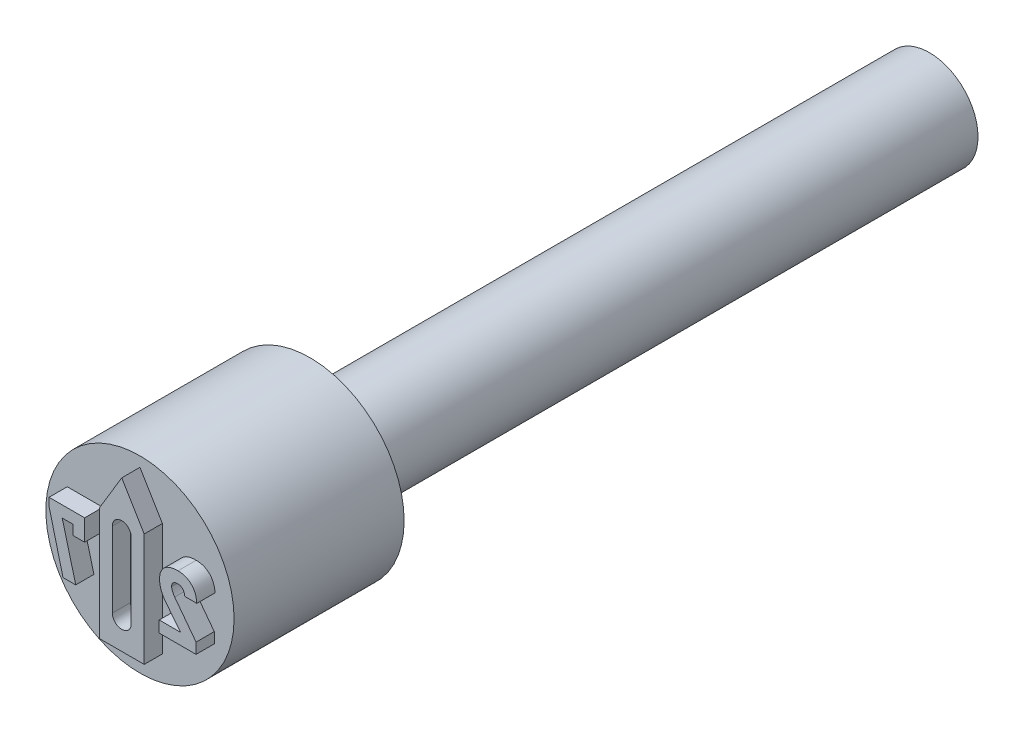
ISO-10303-21;
HEADER;
FILE_DESCRIPTION(('STEP AP214'),'2;1');
FILE_NAME('part.step','',(''),(''),'','','');
FILE_SCHEMA(('AUTOMOTIVE_DESIGN { 1 0 10303 214 1 1 1 1 }'));
ENDSEC;
DATA;
#1=APPLICATION_CONTEXT('core data for automotive mechanical design processes');
#2=APPLICATION_PROTOCOL_DEFINITION('international standard','automotive_design',2000,#1);
#3=PRODUCT_CONTEXT('',#1,'mechanical');
#4=PRODUCT('Part','Part','',(#3));
#5=PRODUCT_RELATED_PRODUCT_CATEGORY('part','',(#4));
#6=PRODUCT_DEFINITION_FORMATION('','',#4);
#7=PRODUCT_DEFINITION_CONTEXT('part definition',#1,'design');
#8=PRODUCT_DEFINITION('design','',#6,#7);
#9=PRODUCT_DEFINITION_SHAPE('','',#8);
#10=(LENGTH_UNIT() NAMED_UNIT(*) SI_UNIT(.MILLI.,.METRE.));
#11=(NAMED_UNIT(*) PLANE_ANGLE_UNIT() SI_UNIT($,.RADIAN.));
#12=(NAMED_UNIT(*) SI_UNIT($,.STERADIAN.) SOLID_ANGLE_UNIT());
#13=UNCERTAINTY_MEASURE_WITH_UNIT(LENGTH_MEASURE(1.E-05),#10,'distance_accuracy_value','');
#14=(GEOMETRIC_REPRESENTATION_CONTEXT(3) GLOBAL_UNCERTAINTY_ASSIGNED_CONTEXT((#13)) GLOBAL_UNIT_ASSIGNED_CONTEXT((#10,
#11,#12)) REPRESENTATION_CONTEXT('',''));
#15=CARTESIAN_POINT('',(0.,0.,0.));
#16=DIRECTION('',(0.,0.,1.));
#17=DIRECTION('',(1.,0.,0.));
#18=AXIS2_PLACEMENT_3D('',#15,#16,#17);
#19=CARTESIAN_POINT('',(0.,0.799999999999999,-2.8));
#20=DIRECTION('',(0.,0.,1.));
#21=DIRECTION('',(1.,0.,0.));
#22=AXIS2_PLACEMENT_3D('',#19,#20,#21);
#23=PLANE('',#22);
#24=CARTESIAN_POINT('',(0.,0.,-2.8));
#25=DIRECTION('',(0.,0.,1.));
#26=DIRECTION('',(1.,0.,0.));
#27=AXIS2_PLACEMENT_3D('',#24,#25,#26);
#28=CIRCLE('',#27,1.55);
#29=CARTESIAN_POINT('',(1.55,0.,-2.8));
#30=VERTEX_POINT('',#29);
#31=EDGE_CURVE('E11',#30,#30,#28,.T.);
#32=ORIENTED_EDGE('',*,*,#31,.F.);
#33=EDGE_LOOP('',(#32));
#34=FACE_BOUND('',#33,.T.);
#35=CARTESIAN_POINT('',(0.,0.,-2.8));
#36=DIRECTION('',(0.,0.,1.));
#37=DIRECTION('',(1.,0.,0.));
#38=AXIS2_PLACEMENT_3D('',#35,#36,#37);
#39=CIRCLE('',#38,0.799999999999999);
#40=CARTESIAN_POINT('',(0.799999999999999,0.,-2.8));
#41=VERTEX_POINT('',#40);
#42=EDGE_CURVE('E619',#41,#41,#39,.T.);
#43=ORIENTED_EDGE('',*,*,#42,.T.);
#44=EDGE_LOOP('',(#43));
#45=FACE_BOUND('',#44,.T.);
#46=ADVANCED_FACE('F39',(#34,#45),#23,.F.);
#47=CARTESIAN_POINT('',(0.,0.,-0.403888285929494));
#48=DIRECTION('',(0.,0.,1.));
#49=DIRECTION('',(1.,0.,0.));
#50=AXIS2_PLACEMENT_3D('',#47,#48,#49);
#51=CYLINDRICAL_SURFACE('',#50,1.55);
#52=CARTESIAN_POINT('',(0.,0.,0.));
#53=DIRECTION('',(0.,0.,1.));
#54=DIRECTION('',(1.,0.,0.));
#55=AXIS2_PLACEMENT_3D('',#52,#53,#54);
#56=CIRCLE('',#55,1.55);
#57=CARTESIAN_POINT('',(1.55,0.,0.));
#58=VERTEX_POINT('',#57);
#59=EDGE_CURVE('E47',#58,#58,#56,.T.);
#60=ORIENTED_EDGE('',*,*,#59,.F.);
#61=EDGE_LOOP('',(#60));
#62=FACE_BOUND('',#61,.T.);
#63=ORIENTED_EDGE('',*,*,#31,.T.);
#64=EDGE_LOOP('',(#63));
#65=FACE_BOUND('',#64,.T.);
#66=ADVANCED_FACE('F604',(#62,#65),#51,.T.);
#67=CARTESIAN_POINT('',(0.,1.55,0.));
#68=DIRECTION('',(0.,0.,-1.));
#69=DIRECTION('',(-1.,0.,0.));
#70=AXIS2_PLACEMENT_3D('',#67,#68,#69);
#71=PLANE('',#70);
#72=DIRECTION('',(-0.515038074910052,0.857167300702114,0.));
#73=VECTOR('',#72,1.);
#74=CARTESIAN_POINT('',(0.37,0.77,0.));
#75=LINE('',#74,#73);
#76=CARTESIAN_POINT('',(0.37,0.77,0.));
#77=VERTEX_POINT('',#76);
#78=CARTESIAN_POINT('',(0.,1.3857834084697,0.));
#79=VERTEX_POINT('',#78);
#80=EDGE_CURVE('E1234',#77,#79,#75,.T.);
#81=ORIENTED_EDGE('',*,*,#80,.F.);
#82=DIRECTION('',(0.,1.,0.));
#83=VECTOR('',#82,1.);
#84=CARTESIAN_POINT('',(0.37,-1.09,0.));
#85=LINE('',#84,#83);
#86=CARTESIAN_POINT('',(0.37,-1.09,0.));
#87=VERTEX_POINT('',#86);
#88=EDGE_CURVE('E512',#87,#77,#85,.T.);
#89=ORIENTED_EDGE('',*,*,#88,.F.);
#90=DIRECTION('',(1.,0.,0.));
#91=VECTOR('',#90,1.);
#92=CARTESIAN_POINT('',(-0.37,-1.09,0.));
#93=LINE('',#92,#91);
#94=CARTESIAN_POINT('',(-0.37,-1.09,0.));
#95=VERTEX_POINT('',#94);
#96=EDGE_CURVE('E1243',#95,#87,#93,.T.);
#97=ORIENTED_EDGE('',*,*,#96,.F.);
#98=DIRECTION('',(0.,-1.,0.));
#99=VECTOR('',#98,1.);
#100=CARTESIAN_POINT('',(-0.37,0.77,0.));
#101=LINE('',#100,#99);
#102=CARTESIAN_POINT('',(-0.37,0.77,0.));
#103=VERTEX_POINT('',#102);
#104=EDGE_CURVE('E1241',#103,#95,#101,.T.);
#105=ORIENTED_EDGE('',*,*,#104,.F.);
#106=DIRECTION('',(-0.515038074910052,-0.857167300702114,0.));
#107=VECTOR('',#106,1.);
#108=CARTESIAN_POINT('',(0.,1.3857834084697,0.));
#109=LINE('',#108,#107);
#110=EDGE_CURVE('E1236',#79,#103,#109,.T.);
#111=ORIENTED_EDGE('',*,*,#110,.F.);
#112=EDGE_LOOP('',(#81,#89,#97,#105,#111));
#113=FACE_BOUND('',#112,.T.);
#114=DIRECTION('',(0.,-1.,0.));
#115=VECTOR('',#114,1.);
#116=CARTESIAN_POINT('',(-1.19718149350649,0.51,0.));
#117=LINE('',#116,#115);
#118=CARTESIAN_POINT('',(-1.19718149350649,0.51,0.));
#119=VERTEX_POINT('',#118);
#120=CARTESIAN_POINT('',(-1.19718149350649,0.38083198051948,0.));
#121=VERTEX_POINT('',#120);
#122=EDGE_CURVE('E1247',#119,#121,#117,.T.);
#123=ORIENTED_EDGE('',*,*,#122,.F.);
#124=DIRECTION('',(-1.,0.,0.));
#125=VECTOR('',#124,1.);
#126=CARTESIAN_POINT('',(-0.611118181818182,0.51,0.));
#127=LINE('',#126,#125);
#128=CARTESIAN_POINT('',(-0.611118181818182,0.51,0.));
#129=VERTEX_POINT('',#128);
#130=EDGE_CURVE('E1244',#129,#119,#127,.T.);
#131=ORIENTED_EDGE('',*,*,#130,.F.);
#132=DIRECTION('',(0.,1.,0.));
#133=VECTOR('',#132,1.);
#134=CARTESIAN_POINT('',(-0.611118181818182,0.162207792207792,0.));
#135=LINE('',#134,#133);
#136=CARTESIAN_POINT('',(-0.611118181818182,0.162207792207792,0.));
#137=VERTEX_POINT('',#136);
#138=EDGE_CURVE('E723',#137,#129,#135,.T.);
#139=ORIENTED_EDGE('',*,*,#138,.F.);
#140=DIRECTION('',(1.,0.,0.));
#141=VECTOR('',#140,1.);
#142=CARTESIAN_POINT('',(-0.804452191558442,0.162207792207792,0.));
#143=LINE('',#142,#141);
#144=CARTESIAN_POINT('',(-0.804452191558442,0.162207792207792,0.));
#145=VERTEX_POINT('',#144);
#146=EDGE_CURVE('E1269',#145,#137,#143,.T.);
#147=ORIENTED_EDGE('',*,*,#146,.F.);
#148=DIRECTION('',(0.,-1.,0.));
#149=VECTOR('',#148,1.);
#150=CARTESIAN_POINT('',(-0.804452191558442,0.322727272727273,0.));
#151=LINE('',#150,#149);
#152=CARTESIAN_POINT('',(-0.804452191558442,0.322727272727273,0.));
#153=VERTEX_POINT('',#152);
#154=EDGE_CURVE('E1266',#153,#145,#151,.T.);
#155=ORIENTED_EDGE('',*,*,#154,.F.);
#156=DIRECTION('',(1.,0.,0.));
#157=VECTOR('',#156,1.);
#158=CARTESIAN_POINT('',(-0.980647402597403,0.322727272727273,0.));
#159=LINE('',#158,#157);
#160=CARTESIAN_POINT('',(-0.980647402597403,0.322727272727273,0.));
#161=VERTEX_POINT('',#160);
#162=EDGE_CURVE('E1263',#161,#153,#159,.T.);
#163=ORIENTED_EDGE('',*,*,#162,.F.);
#164=DIRECTION('',(-0.255602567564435,0.966781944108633,0.));
#165=VECTOR('',#164,1.);
#166=CARTESIAN_POINT('',(-0.75784301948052,-0.52,0.));
#167=LINE('',#166,#165);
#168=CARTESIAN_POINT('',(-0.75784301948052,-0.52,0.));
#169=VERTEX_POINT('',#168);
#170=EDGE_CURVE('E1260',#169,#161,#167,.T.);
#171=ORIENTED_EDGE('',*,*,#170,.F.);
#172=DIRECTION('',(1.,0.,0.));
#173=VECTOR('',#172,1.);
#174=CARTESIAN_POINT('',(-0.96727077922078,-0.52,0.));
#175=LINE('',#174,#173);
#176=CARTESIAN_POINT('',(-0.96727077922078,-0.52,0.));
#177=VERTEX_POINT('',#176);
#178=EDGE_CURVE('E1257',#177,#169,#175,.T.);
#179=ORIENTED_EDGE('',*,*,#178,.F.);
#180=DIRECTION('',(0.247293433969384,-0.968940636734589,0.));
#181=VECTOR('',#180,1.);
#182=CARTESIAN_POINT('',(-1.19718149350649,0.38083198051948,0.));
#183=LINE('',#182,#181);
#184=EDGE_CURVE('E1254',#121,#177,#183,.T.);
#185=ORIENTED_EDGE('',*,*,#184,.F.);
#186=EDGE_LOOP('',(#123,#131,#139,#147,#155,#163,#171,#179,#185));
#187=FACE_BOUND('',#186,.T.);
#188=DIRECTION('',(0.,1.,0.));
#189=VECTOR('',#188,1.);
#190=CARTESIAN_POINT('',(1.2237114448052,-0.52,0.));
#191=LINE('',#190,#189);
#192=CARTESIAN_POINT('',(1.2237114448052,-0.52,0.));
#193=VERTEX_POINT('',#192);
#194=CARTESIAN_POINT('',(1.2237114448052,-0.344849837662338,0.));
#195=VERTEX_POINT('',#194);
#196=EDGE_CURVE('E717',#193,#195,#191,.T.);
#197=ORIENTED_EDGE('',*,*,#196,.F.);
#198=DIRECTION('',(1.,0.,0.));
#199=VECTOR('',#198,1.);
#200=CARTESIAN_POINT('',(0.617165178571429,-0.52,0.));
#201=LINE('',#200,#199);
#202=CARTESIAN_POINT('',(0.617165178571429,-0.52,0.));
#203=VERTEX_POINT('',#202);
#204=EDGE_CURVE('E63',#203,#193,#201,.T.);
#205=ORIENTED_EDGE('',*,*,#204,.F.);
#206=DIRECTION('',(0.,-1.,0.));
#207=VECTOR('',#206,1.);
#208=CARTESIAN_POINT('',(0.617165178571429,-0.332727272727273,0.));
#209=LINE('',#208,#207);
#210=CARTESIAN_POINT('',(0.617165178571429,-0.332727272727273,0.));
#211=VERTEX_POINT('',#210);
#212=EDGE_CURVE('E621',#211,#203,#209,.T.);
#213=ORIENTED_EDGE('',*,*,#212,.F.);
#214=DIRECTION('',(-1.,0.,0.));
#215=VECTOR('',#214,1.);
#216=CARTESIAN_POINT('',(0.967674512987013,-0.332727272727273,0.));
#217=LINE('',#216,#215);
#218=CARTESIAN_POINT('',(0.967674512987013,-0.332727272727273,0.));
#219=VERTEX_POINT('',#218);
#220=EDGE_CURVE('E625',#219,#211,#217,.T.);
#221=ORIENTED_EDGE('',*,*,#220,.F.);
#222=DIRECTION('',(0.618183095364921,-0.786034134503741,0.));
#223=VECTOR('',#222,1.);
#224=CARTESIAN_POINT('',(0.715190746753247,-0.0116883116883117,0.));
#225=LINE('',#224,#223);
#226=CARTESIAN_POINT('',(0.715190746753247,-0.0116883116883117,0.));
#227=VERTEX_POINT('',#226);
#228=EDGE_CURVE('E633',#227,#219,#225,.T.);
#229=ORIENTED_EDGE('',*,*,#228,.F.);
#230=CARTESIAN_POINT('',(0.622808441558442,0.253336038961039,0.));
#231=CARTESIAN_POINT('',(0.623074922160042,0.241616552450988,0.));
#232=CARTESIAN_POINT('',(0.623608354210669,0.218156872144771,0.));
#233=CARTESIAN_POINT('',(0.628423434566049,0.1830461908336,0.));
#234=CARTESIAN_POINT('',(0.636182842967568,0.148114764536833,0.));
#235=CARTESIAN_POINT('',(0.646839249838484,0.113531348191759,0.));
#236=CARTESIAN_POINT('',(0.660077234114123,0.0798949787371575,0.));
#237=CARTESIAN_POINT('',(0.675965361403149,0.0476663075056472,0.));
#238=CARTESIAN_POINT('',(0.693897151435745,0.0168310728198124,0.));
#239=CARTESIAN_POINT('',(0.708106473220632,-0.00220005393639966,0.));
#240=CARTESIAN_POINT('',(0.715190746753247,-0.0116883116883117,0.));
#241=B_SPLINE_CURVE_WITH_KNOTS('',3,(#230,#231,#232,#233,#234,#235,#236,#237,#238,#239,#240),
.UNSPECIFIED.,.F.,.F.,(4,1,1,1,1,1,1,1,4),(0.,0.123046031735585,0.246309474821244,
0.371480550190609,0.498560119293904,0.626024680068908,0.750715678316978,0.875715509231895,1.),.UNSPECIFIED.);
#242=CARTESIAN_POINT('',(0.622808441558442,0.253336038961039,0.));
#243=VERTEX_POINT('',#242);
#244=EDGE_CURVE('E630',#243,#227,#241,.T.);
#245=ORIENTED_EDGE('',*,*,#244,.F.);
#246=DIRECTION('',(0.,-1.,0.));
#247=VECTOR('',#246,1.);
#248=CARTESIAN_POINT('',(0.622808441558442,0.254172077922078,0.));
#249=LINE('',#248,#247);
#250=CARTESIAN_POINT('',(0.622808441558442,0.254172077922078,0.));
#251=VERTEX_POINT('',#250);
#252=EDGE_CURVE('E634',#251,#243,#249,.T.);
#253=ORIENTED_EDGE('',*,*,#252,.F.);
#254=CARTESIAN_POINT('',(0.926081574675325,0.523376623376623,0.));
#255=CARTESIAN_POINT('',(0.914367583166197,0.523210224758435,0.));
#256=CARTESIAN_POINT('',(0.891585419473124,0.522886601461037,0.));
#257=CARTESIAN_POINT('',(0.858418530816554,0.519393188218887,0.));
#258=CARTESIAN_POINT('',(0.82721200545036,0.514120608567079,0.));
#259=CARTESIAN_POINT('',(0.79801605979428,0.506407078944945,0.));
#260=CARTESIAN_POINT('',(0.770947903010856,0.496345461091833,0.));
#261=CARTESIAN_POINT('',(0.745926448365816,0.484213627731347,0.));
#262=CARTESIAN_POINT('',(0.722899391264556,0.469908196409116,0.));
#263=CARTESIAN_POINT('',(0.702043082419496,0.453398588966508,0.));
#264=CARTESIAN_POINT('',(0.683277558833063,0.434984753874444,0.));
#265=CARTESIAN_POINT('',(0.667125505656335,0.414479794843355,0.));
#266=CARTESIAN_POINT('',(0.65314322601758,0.392298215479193,0.));
#267=CARTESIAN_POINT('',(0.6422133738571,0.368009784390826,0.));
#268=CARTESIAN_POINT('',(0.633215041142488,0.342185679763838,0.));
#269=CARTESIAN_POINT('',(0.627388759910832,0.314363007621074,0.));
#270=CARTESIAN_POINT('',(0.623462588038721,0.284869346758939,0.));
#271=CARTESIAN_POINT('',(0.623029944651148,0.264566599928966,0.));
#272=CARTESIAN_POINT('',(0.622808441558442,0.254172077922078,0.));
#273=B_SPLINE_CURVE_WITH_KNOTS('',3,(#254,#255,#256,#257,#258,#259,#260,#261,#262,#263,#264,
#265,#266,#267,#268,#269,#270,#271,#272),.UNSPECIFIED.,.F.,.F.,(4,1,1,1,1,1,1,1,1,1,1,1,1,1,1,1,
4),(0.,0.0762312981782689,0.148259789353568,0.216860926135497,0.28210063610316,
0.344528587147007,0.404571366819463,0.462840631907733,0.520642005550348,0.577409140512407,
0.633580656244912,0.690215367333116,0.747647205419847,0.806597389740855,0.867894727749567,
0.932365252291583,1.),.UNSPECIFIED.);
#274=CARTESIAN_POINT('',(0.926081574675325,0.523376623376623,0.));
#275=VERTEX_POINT('',#274);
#276=EDGE_CURVE('E648',#275,#251,#273,.T.);
#277=ORIENTED_EDGE('',*,*,#276,.F.);
#278=CARTESIAN_POINT('',(1.23646103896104,0.214251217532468,0.));
#279=CARTESIAN_POINT('',(1.23548333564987,0.226190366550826,0.));
#280=CARTESIAN_POINT('',(1.23357487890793,0.249495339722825,0.));
#281=CARTESIAN_POINT('',(1.22731812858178,0.28320704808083,0.));
#282=CARTESIAN_POINT('',(1.21923152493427,0.314961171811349,0.));
#283=CARTESIAN_POINT('',(1.20894427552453,0.344751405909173,0.));
#284=CARTESIAN_POINT('',(1.19572512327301,0.372232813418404,0.));
#285=CARTESIAN_POINT('',(1.18087300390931,0.39797988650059,0.));
#286=CARTESIAN_POINT('',(1.16300962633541,0.42119628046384,0.));
#287=CARTESIAN_POINT('',(1.14345565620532,0.442658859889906,0.));
#288=CARTESIAN_POINT('',(1.12167603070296,0.461562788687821,0.));
#289=CARTESIAN_POINT('',(1.09845296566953,0.478238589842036,0.));
#290=CARTESIAN_POINT('',(1.07343529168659,0.492115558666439,0.));
#291=CARTESIAN_POINT('',(1.04700334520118,0.503627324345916,0.));
#292=CARTESIAN_POINT('',(1.01886407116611,0.512364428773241,0.));
#293=CARTESIAN_POINT('',(0.98938503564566,0.51890918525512,0.));
#294=CARTESIAN_POINT('',(0.958227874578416,0.522683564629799,0.));
#295=CARTESIAN_POINT('',(0.936960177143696,0.52314208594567,0.));
#296=CARTESIAN_POINT('',(0.926081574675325,0.523376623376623,0.));
#297=B_SPLINE_CURVE_WITH_KNOTS('',3,(#278,#279,#280,#281,#282,#283,#284,#285,#286,#287,#288,
#289,#290,#291,#292,#293,#294,#295,#296),.UNSPECIFIED.,.F.,.F.,(4,1,1,1,1,1,1,1,1,1,1,1,1,1,1,1,
4),(0.,0.0733268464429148,0.143132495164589,0.209679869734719,0.273918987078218,
0.33576228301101,0.396210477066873,0.45560885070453,0.514796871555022,0.573764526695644,
0.631900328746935,0.689592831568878,0.748648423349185,0.808163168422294,0.86976604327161,
0.933384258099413,1.),.UNSPECIFIED.);
#298=CARTESIAN_POINT('',(1.23646103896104,0.214251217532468,0.));
#299=VERTEX_POINT('',#298);
#300=EDGE_CURVE('E653',#299,#275,#297,.T.);
#301=ORIENTED_EDGE('',*,*,#300,.F.);
#302=DIRECTION('',(0.,1.,0.));
#303=VECTOR('',#302,1.);
#304=CARTESIAN_POINT('',(1.23646103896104,0.213624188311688,0.));
#305=LINE('',#304,#303);
#306=CARTESIAN_POINT('',(1.23646103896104,0.213624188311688,0.));
#307=VERTEX_POINT('',#306);
#308=EDGE_CURVE('E663',#307,#299,#305,.T.);
#309=ORIENTED_EDGE('',*,*,#308,.F.);
#310=DIRECTION('',(1.,0.,0.));
#311=VECTOR('',#310,1.);
#312=CARTESIAN_POINT('',(1.03831980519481,0.213624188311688,0.));
#313=LINE('',#312,#311);
#314=CARTESIAN_POINT('',(1.03831980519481,0.213624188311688,0.));
#315=VERTEX_POINT('',#314);
#316=EDGE_CURVE('E673',#315,#307,#313,.T.);
#317=ORIENTED_EDGE('',*,*,#316,.F.);
#318=DIRECTION('',(0.,-1.,0.));
#319=VECTOR('',#318,1.);
#320=CARTESIAN_POINT('',(1.03831980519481,0.214251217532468,0.));
#321=LINE('',#320,#319);
#322=CARTESIAN_POINT('',(1.03831980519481,0.214251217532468,0.));
#323=VERTEX_POINT('',#322);
#324=EDGE_CURVE('E679',#323,#315,#321,.T.);
#325=ORIENTED_EDGE('',*,*,#324,.F.);
#326=CARTESIAN_POINT('',(0.924618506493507,0.336103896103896,0.));
#327=CARTESIAN_POINT('',(0.932190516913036,0.335808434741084,0.));
#328=CARTESIAN_POINT('',(0.946903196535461,0.335234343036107,0.));
#329=CARTESIAN_POINT('',(0.967731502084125,0.328871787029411,0.));
#330=CARTESIAN_POINT('',(0.986499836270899,0.318891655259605,0.));
#331=CARTESIAN_POINT('',(1.00267963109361,0.30465126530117,0.));
#332=CARTESIAN_POINT('',(1.01607772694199,0.2867719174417,0.));
#333=CARTESIAN_POINT('',(1.02695157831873,0.265717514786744,0.));
#334=CARTESIAN_POINT('',(1.03433701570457,0.241107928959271,0.));
#335=CARTESIAN_POINT('',(1.03694949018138,0.223491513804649,0.));
#336=CARTESIAN_POINT('',(1.03831980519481,0.214251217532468,0.));
#337=B_SPLINE_CURVE_WITH_KNOTS('',3,(#326,#327,#328,#329,#330,#331,#332,#333,#334,#335,#336),
.UNSPECIFIED.,.F.,.F.,(4,1,1,1,1,1,1,1,4),(0.,0.122603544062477,0.238222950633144,
0.350089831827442,0.465559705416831,0.58502806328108,0.711014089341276,0.848418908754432,1.),.UNSPECIFIED.);
#338=CARTESIAN_POINT('',(0.924618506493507,0.336103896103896,0.));
#339=VERTEX_POINT('',#338);
#340=EDGE_CURVE('E676',#339,#323,#337,.T.);
#341=ORIENTED_EDGE('',*,*,#340,.F.);
#342=CARTESIAN_POINT('',(0.821785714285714,0.248737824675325,0.));
#343=CARTESIAN_POINT('',(0.822071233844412,0.255323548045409,0.));
#344=CARTESIAN_POINT('',(0.822618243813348,0.267940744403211,0.));
#345=CARTESIAN_POINT('',(0.827771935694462,0.285718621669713,0.));
#346=CARTESIAN_POINT('',(0.836218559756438,0.301200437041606,0.));
#347=CARTESIAN_POINT('',(0.848316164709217,0.313988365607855,0.));
#348=CARTESIAN_POINT('',(0.863376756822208,0.324102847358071,0.));
#349=CARTESIAN_POINT('',(0.881397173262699,0.331230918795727,0.));
#350=CARTESIAN_POINT('',(0.902141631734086,0.335318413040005,0.));
#351=CARTESIAN_POINT('',(0.916865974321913,0.335832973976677,0.));
#352=CARTESIAN_POINT('',(0.924618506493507,0.336103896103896,0.));
#353=B_SPLINE_CURVE_WITH_KNOTS('',3,(#342,#343,#344,#345,#346,#347,#348,#349,#350,#351,#352),
.UNSPECIFIED.,.F.,.F.,(4,1,1,1,1,1,1,1,4),(0.,0.128749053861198,0.246662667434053,
0.359069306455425,0.471077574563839,0.588039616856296,0.711712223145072,0.848213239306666,1.),.UNSPECIFIED.);
#354=CARTESIAN_POINT('',(0.821785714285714,0.248737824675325,0.));
#355=VERTEX_POINT('',#354);
#356=EDGE_CURVE('E680',#355,#339,#353,.T.);
#357=ORIENTED_EDGE('',*,*,#356,.F.);
#358=DIRECTION('',(0.,1.,0.));
#359=VECTOR('',#358,1.);
#360=CARTESIAN_POINT('',(0.821785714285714,0.247274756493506,0.));
#361=LINE('',#360,#359);
#362=CARTESIAN_POINT('',(0.821785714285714,0.247274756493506,0.));
#363=VERTEX_POINT('',#362);
#364=EDGE_CURVE('E694',#363,#355,#361,.T.);
#365=ORIENTED_EDGE('',*,*,#364,.F.);
#366=CARTESIAN_POINT('',(0.871739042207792,0.121450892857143,0.));
#367=CARTESIAN_POINT('',(0.864366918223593,0.131838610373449,0.));
#368=CARTESIAN_POINT('',(0.850002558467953,0.152078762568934,0.));
#369=CARTESIAN_POINT('',(0.837001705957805,0.179874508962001,0.));
#370=CARTESIAN_POINT('',(0.828902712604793,0.201666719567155,0.));
#371=CARTESIAN_POINT('',(0.825042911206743,0.217470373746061,0.));
#372=CARTESIAN_POINT('',(0.822289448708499,0.232548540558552,0.));
#373=CARTESIAN_POINT('',(0.821950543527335,0.242456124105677,0.));
#374=CARTESIAN_POINT('',(0.821785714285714,0.247274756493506,0.));
#375=B_SPLINE_CURVE_WITH_KNOTS('',3,(#366,#367,#368,#369,#370,#371,#372,#373,#374),
.UNSPECIFIED.,.F.,.F.,(4,1,1,1,1,1,4),(0.,0.277375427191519,0.540457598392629,0.666416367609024,
0.784009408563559,0.894951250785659,1.),.UNSPECIFIED.);
#376=CARTESIAN_POINT('',(0.871739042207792,0.121450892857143,0.));
#377=VERTEX_POINT('',#376);
#378=EDGE_CURVE('E704',#377,#363,#375,.T.);
#379=ORIENTED_EDGE('',*,*,#378,.F.);
#380=DIRECTION('',(-0.602458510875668,0.798150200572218,0.));
#381=VECTOR('',#380,1.);
#382=CARTESIAN_POINT('',(1.2237114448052,-0.344849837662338,0.));
#383=LINE('',#382,#381);
#384=EDGE_CURVE('E709',#195,#377,#383,.T.);
#385=ORIENTED_EDGE('',*,*,#384,.F.);
#386=EDGE_LOOP('',(#197,#205,#213,#221,#229,#245,#253,#277,#301,#309,#317,#325,#341,#357,#365,
#379,#385));
#387=FACE_BOUND('',#386,.T.);
#388=ORIENTED_EDGE('',*,*,#59,.T.);
#389=EDGE_LOOP('',(#388));
#390=FACE_BOUND('',#389,.T.);
#391=ADVANCED_FACE('F601',(#113,#187,#387,#390),#71,.F.);
#392=CARTESIAN_POINT('',(0.,0.,-13.));
#393=DIRECTION('',(0.,0.,1.));
#394=DIRECTION('',(1.,0.,0.));
#395=AXIS2_PLACEMENT_3D('',#392,#393,#394);
#396=PLANE('',#395);
#397=CARTESIAN_POINT('',(0.,0.,-13.));
#398=DIRECTION('',(0.,0.,1.));
#399=DIRECTION('',(1.,0.,0.));
#400=AXIS2_PLACEMENT_3D('',#397,#398,#399);
#401=CIRCLE('',#400,0.800000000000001);
#402=CARTESIAN_POINT('',(0.800000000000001,0.,-13.));
#403=VERTEX_POINT('',#402);
#404=EDGE_CURVE('E620',#403,#403,#401,.T.);
#405=ORIENTED_EDGE('',*,*,#404,.F.);
#406=EDGE_LOOP('',(#405));
#407=FACE_BOUND('',#406,.T.);
#408=ADVANCED_FACE('F597',(#407),#396,.F.);
#409=CARTESIAN_POINT('',(0.,0.,-0.403888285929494));
#410=DIRECTION('',(0.,0.,1.));
#411=DIRECTION('',(1.,0.,0.));
#412=AXIS2_PLACEMENT_3D('',#409,#410,#411);
#413=CYLINDRICAL_SURFACE('',#412,0.8);
#414=ORIENTED_EDGE('',*,*,#42,.F.);
#415=EDGE_LOOP('',(#414));
#416=FACE_BOUND('',#415,.T.);
#417=ORIENTED_EDGE('',*,*,#404,.T.);
#418=EDGE_LOOP('',(#417));
#419=FACE_BOUND('',#418,.T.);
#420=ADVANCED_FACE('F593',(#416,#419),#413,.T.);
#421=CARTESIAN_POINT('',(1.2237114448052,-0.52,-2.98400918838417));
#422=DIRECTION('',(1.,0.,0.));
#423=DIRECTION('',(0.,0.,-1.));
#424=AXIS2_PLACEMENT_3D('',#421,#422,#423);
#425=PLANE('',#424);
#426=ORIENTED_EDGE('',*,*,#196,.T.);
#427=DIRECTION('',(0.,0.,1.));
#428=VECTOR('',#427,1.);
#429=CARTESIAN_POINT('',(1.2237114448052,-0.344849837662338,-2.98400918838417));
#430=LINE('',#429,#428);
#431=CARTESIAN_POINT('',(1.2237114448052,-0.344849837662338,0.3));
#432=VERTEX_POINT('',#431);
#433=EDGE_CURVE('E456',#195,#432,#430,.T.);
#434=ORIENTED_EDGE('',*,*,#433,.T.);
#435=DIRECTION('',(0.,1.,0.));
#436=VECTOR('',#435,1.);
#437=CARTESIAN_POINT('',(1.2237114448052,-0.52,0.3));
#438=LINE('',#437,#436);
#439=CARTESIAN_POINT('',(1.2237114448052,-0.52,0.3));
#440=VERTEX_POINT('',#439);
#441=EDGE_CURVE('E378',#440,#432,#438,.T.);
#442=ORIENTED_EDGE('',*,*,#441,.F.);
#443=DIRECTION('',(0.,0.,1.));
#444=VECTOR('',#443,1.);
#445=CARTESIAN_POINT('',(1.2237114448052,-0.52,-2.98400918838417));
#446=LINE('',#445,#444);
#447=EDGE_CURVE('E459',#193,#440,#446,.T.);
#448=ORIENTED_EDGE('',*,*,#447,.F.);
#449=EDGE_LOOP('',(#426,#434,#442,#448));
#450=FACE_BOUND('',#449,.T.);
#451=ADVANCED_FACE('F589',(#450),#425,.T.);
#452=CARTESIAN_POINT('',(1.2237114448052,-0.344849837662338,-2.98400918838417));
#453=DIRECTION('',(0.798150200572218,0.602458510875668,0.));
#454=DIRECTION('',(-0.602458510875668,0.798150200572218,0.));
#455=AXIS2_PLACEMENT_3D('',#452,#453,#454);
#456=PLANE('',#455);
#457=ORIENTED_EDGE('',*,*,#384,.T.);
#458=DIRECTION('',(0.,0.,1.));
#459=VECTOR('',#458,1.);
#460=CARTESIAN_POINT('',(0.871739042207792,0.121450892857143,-2.98400918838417));
#461=LINE('',#460,#459);
#462=CARTESIAN_POINT('',(0.871739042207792,0.121450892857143,0.3));
#463=VERTEX_POINT('',#462);
#464=EDGE_CURVE('E510',#377,#463,#461,.T.);
#465=ORIENTED_EDGE('',*,*,#464,.T.);
#466=DIRECTION('',(-0.602458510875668,0.798150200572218,0.));
#467=VECTOR('',#466,1.);
#468=CARTESIAN_POINT('',(1.2237114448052,-0.344849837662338,0.3));
#469=LINE('',#468,#467);
#470=EDGE_CURVE('E381',#432,#463,#469,.T.);
#471=ORIENTED_EDGE('',*,*,#470,.F.);
#472=ORIENTED_EDGE('',*,*,#433,.F.);
#473=EDGE_LOOP('',(#457,#465,#471,#472));
#474=FACE_BOUND('',#473,.T.);
#475=ADVANCED_FACE('F585',(#474),#456,.T.);
#476=CARTESIAN_POINT('',(0.871739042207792,0.121450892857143,-2.98400918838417));
#477=CARTESIAN_POINT('',(0.864366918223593,0.131838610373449,-2.98400918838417));
#478=CARTESIAN_POINT('',(0.850002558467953,0.152078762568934,-2.98400918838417));
#479=CARTESIAN_POINT('',(0.837001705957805,0.179874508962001,-2.98400918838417));
#480=CARTESIAN_POINT('',(0.828902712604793,0.201666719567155,-2.98400918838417));
#481=CARTESIAN_POINT('',(0.825042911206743,0.217470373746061,-2.98400918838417));
#482=CARTESIAN_POINT('',(0.822289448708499,0.232548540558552,-2.98400918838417));
#483=CARTESIAN_POINT('',(0.821950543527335,0.242456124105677,-2.98400918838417));
#484=CARTESIAN_POINT('',(0.821785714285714,0.247274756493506,-2.98400918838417));
#485=B_SPLINE_CURVE_WITH_KNOTS('',3,(#476,#477,#478,#479,#480,#481,#482,#483,#484),
.UNSPECIFIED.,.F.,.F.,(4,1,1,1,1,1,4),(0.,0.277375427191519,0.540457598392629,0.666416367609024,
0.784009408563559,0.894951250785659,1.),.UNSPECIFIED.);
#486=DIRECTION('',(0.,0.,1.));
#487=VECTOR('',#486,1.);
#488=SURFACE_OF_LINEAR_EXTRUSION('',#485,#487);
#489=ORIENTED_EDGE('',*,*,#378,.T.);
#490=DIRECTION('',(0.,0.,1.));
#491=VECTOR('',#490,1.);
#492=CARTESIAN_POINT('',(0.821785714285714,0.247274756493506,-2.98400918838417));
#493=LINE('',#492,#491);
#494=CARTESIAN_POINT('',(0.821785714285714,0.247274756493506,0.3));
#495=VERTEX_POINT('',#494);
#496=EDGE_CURVE('E508',#363,#495,#493,.T.);
#497=ORIENTED_EDGE('',*,*,#496,.T.);
#498=CARTESIAN_POINT('',(0.871739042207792,0.121450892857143,0.3));
#499=CARTESIAN_POINT('',(0.864366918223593,0.131838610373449,0.3));
#500=CARTESIAN_POINT('',(0.850002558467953,0.152078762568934,0.3));
#501=CARTESIAN_POINT('',(0.837001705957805,0.179874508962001,0.3));
#502=CARTESIAN_POINT('',(0.828902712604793,0.201666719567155,0.3));
#503=CARTESIAN_POINT('',(0.825042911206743,0.217470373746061,0.3));
#504=CARTESIAN_POINT('',(0.822289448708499,0.232548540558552,0.3));
#505=CARTESIAN_POINT('',(0.821950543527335,0.242456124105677,0.3));
#506=CARTESIAN_POINT('',(0.821785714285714,0.247274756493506,0.3));
#507=B_SPLINE_CURVE_WITH_KNOTS('',3,(#498,#499,#500,#501,#502,#503,#504,#505,#506),
.UNSPECIFIED.,.F.,.F.,(4,1,1,1,1,1,4),(0.,0.277375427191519,0.540457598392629,0.666416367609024,
0.784009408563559,0.894951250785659,1.),.UNSPECIFIED.);
#508=EDGE_CURVE('E384',#463,#495,#507,.T.);
#509=ORIENTED_EDGE('',*,*,#508,.F.);
#510=ORIENTED_EDGE('',*,*,#464,.F.);
#511=EDGE_LOOP('',(#489,#497,#509,#510));
#512=FACE_BOUND('',#511,.T.);
#513=ADVANCED_FACE('F581',(#512),#488,.T.);
#514=CARTESIAN_POINT('',(0.821785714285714,0.247274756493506,-2.98400918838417));
#515=DIRECTION('',(1.,0.,0.));
#516=DIRECTION('',(0.,0.,-1.));
#517=AXIS2_PLACEMENT_3D('',#514,#515,#516);
#518=PLANE('',#517);
#519=ORIENTED_EDGE('',*,*,#364,.T.);
#520=DIRECTION('',(0.,0.,1.));
#521=VECTOR('',#520,1.);
#522=CARTESIAN_POINT('',(0.821785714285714,0.248737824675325,-2.98400918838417));
#523=LINE('',#522,#521);
#524=CARTESIAN_POINT('',(0.821785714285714,0.248737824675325,0.3));
#525=VERTEX_POINT('',#524);
#526=EDGE_CURVE('E506',#355,#525,#523,.T.);
#527=ORIENTED_EDGE('',*,*,#526,.T.);
#528=DIRECTION('',(0.,1.,0.));
#529=VECTOR('',#528,1.);
#530=CARTESIAN_POINT('',(0.821785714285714,0.247274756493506,0.3));
#531=LINE('',#530,#529);
#532=EDGE_CURVE('E389',#495,#525,#531,.T.);
#533=ORIENTED_EDGE('',*,*,#532,.F.);
#534=ORIENTED_EDGE('',*,*,#496,.F.);
#535=EDGE_LOOP('',(#519,#527,#533,#534));
#536=FACE_BOUND('',#535,.T.);
#537=ADVANCED_FACE('F577',(#536),#518,.T.);
#538=CARTESIAN_POINT('',(0.821785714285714,0.248737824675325,-2.98400918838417));
#539=CARTESIAN_POINT('',(0.822071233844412,0.255323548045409,-2.98400918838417));
#540=CARTESIAN_POINT('',(0.822618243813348,0.267940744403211,-2.98400918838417));
#541=CARTESIAN_POINT('',(0.827771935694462,0.285718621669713,-2.98400918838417));
#542=CARTESIAN_POINT('',(0.836218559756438,0.301200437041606,-2.98400918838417));
#543=CARTESIAN_POINT('',(0.848316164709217,0.313988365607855,-2.98400918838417));
#544=CARTESIAN_POINT('',(0.863376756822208,0.324102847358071,-2.98400918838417));
#545=CARTESIAN_POINT('',(0.881397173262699,0.331230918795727,-2.98400918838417));
#546=CARTESIAN_POINT('',(0.902141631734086,0.335318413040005,-2.98400918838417));
#547=CARTESIAN_POINT('',(0.916865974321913,0.335832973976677,-2.98400918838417));
#548=CARTESIAN_POINT('',(0.924618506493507,0.336103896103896,-2.98400918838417));
#549=B_SPLINE_CURVE_WITH_KNOTS('',3,(#538,#539,#540,#541,#542,#543,#544,#545,#546,#547,#548),
.UNSPECIFIED.,.F.,.F.,(4,1,1,1,1,1,1,1,4),(0.,0.128749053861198,0.246662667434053,
0.359069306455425,0.471077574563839,0.588039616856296,0.711712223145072,0.848213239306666,1.),.UNSPECIFIED.);
#550=DIRECTION('',(0.,0.,1.));
#551=VECTOR('',#550,1.);
#552=SURFACE_OF_LINEAR_EXTRUSION('',#549,#551);
#553=ORIENTED_EDGE('',*,*,#356,.T.);
#554=DIRECTION('',(0.,0.,1.));
#555=VECTOR('',#554,1.);
#556=CARTESIAN_POINT('',(0.924618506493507,0.336103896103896,-2.98400918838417));
#557=LINE('',#556,#555);
#558=CARTESIAN_POINT('',(0.924618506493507,0.336103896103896,0.3));
#559=VERTEX_POINT('',#558);
#560=EDGE_CURVE('E496',#339,#559,#557,.T.);
#561=ORIENTED_EDGE('',*,*,#560,.T.);
#562=CARTESIAN_POINT('',(0.821785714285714,0.248737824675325,0.3));
#563=CARTESIAN_POINT('',(0.822071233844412,0.255323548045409,0.3));
#564=CARTESIAN_POINT('',(0.822618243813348,0.267940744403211,0.3));
#565=CARTESIAN_POINT('',(0.827771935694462,0.285718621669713,0.3));
#566=CARTESIAN_POINT('',(0.836218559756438,0.301200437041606,0.3));
#567=CARTESIAN_POINT('',(0.848316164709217,0.313988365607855,0.3));
#568=CARTESIAN_POINT('',(0.863376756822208,0.324102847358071,0.3));
#569=CARTESIAN_POINT('',(0.881397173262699,0.331230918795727,0.3));
#570=CARTESIAN_POINT('',(0.902141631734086,0.335318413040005,0.3));
#571=CARTESIAN_POINT('',(0.916865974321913,0.335832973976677,0.3));
#572=CARTESIAN_POINT('',(0.924618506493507,0.336103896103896,0.3));
#573=B_SPLINE_CURVE_WITH_KNOTS('',3,(#562,#563,#564,#565,#566,#567,#568,#569,#570,#571,#572),
.UNSPECIFIED.,.F.,.F.,(4,1,1,1,1,1,1,1,4),(0.,0.128749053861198,0.246662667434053,
0.359069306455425,0.471077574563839,0.588039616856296,0.711712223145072,0.848213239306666,1.),.UNSPECIFIED.);
#574=EDGE_CURVE('E395',#525,#559,#573,.T.);
#575=ORIENTED_EDGE('',*,*,#574,.F.);
#576=ORIENTED_EDGE('',*,*,#526,.F.);
#577=EDGE_LOOP('',(#553,#561,#575,#576));
#578=FACE_BOUND('',#577,.T.);
#579=ADVANCED_FACE('F573',(#578),#552,.T.);
#580=CARTESIAN_POINT('',(0.924618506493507,0.336103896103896,-2.98400918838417));
#581=CARTESIAN_POINT('',(0.932190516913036,0.335808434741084,-2.98400918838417));
#582=CARTESIAN_POINT('',(0.946903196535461,0.335234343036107,-2.98400918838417));
#583=CARTESIAN_POINT('',(0.967731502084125,0.328871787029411,-2.98400918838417));
#584=CARTESIAN_POINT('',(0.986499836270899,0.318891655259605,-2.98400918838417));
#585=CARTESIAN_POINT('',(1.00267963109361,0.30465126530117,-2.98400918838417));
#586=CARTESIAN_POINT('',(1.01607772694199,0.2867719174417,-2.98400918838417));
#587=CARTESIAN_POINT('',(1.02695157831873,0.265717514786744,-2.98400918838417));
#588=CARTESIAN_POINT('',(1.03433701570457,0.241107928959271,-2.98400918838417));
#589=CARTESIAN_POINT('',(1.03694949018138,0.223491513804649,-2.98400918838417));
#590=CARTESIAN_POINT('',(1.03831980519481,0.214251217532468,-2.98400918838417));
#591=B_SPLINE_CURVE_WITH_KNOTS('',3,(#580,#581,#582,#583,#584,#585,#586,#587,#588,#589,#590),
.UNSPECIFIED.,.F.,.F.,(4,1,1,1,1,1,1,1,4),(0.,0.122603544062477,0.238222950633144,
0.350089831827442,0.465559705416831,0.58502806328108,0.711014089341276,0.848418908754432,1.),.UNSPECIFIED.);
#592=DIRECTION('',(0.,0.,1.));
#593=VECTOR('',#592,1.);
#594=SURFACE_OF_LINEAR_EXTRUSION('',#591,#593);
#595=ORIENTED_EDGE('',*,*,#340,.T.);
#596=DIRECTION('',(0.,0.,1.));
#597=VECTOR('',#596,1.);
#598=CARTESIAN_POINT('',(1.03831980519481,0.214251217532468,-2.98400918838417));
#599=LINE('',#598,#597);
#600=CARTESIAN_POINT('',(1.03831980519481,0.214251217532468,0.3));
#601=VERTEX_POINT('',#600);
#602=EDGE_CURVE('E492',#323,#601,#599,.T.);
#603=ORIENTED_EDGE('',*,*,#602,.T.);
#604=CARTESIAN_POINT('',(0.924618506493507,0.336103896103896,0.3));
#605=CARTESIAN_POINT('',(0.932190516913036,0.335808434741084,0.3));
#606=CARTESIAN_POINT('',(0.946903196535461,0.335234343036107,0.3));
#607=CARTESIAN_POINT('',(0.967731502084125,0.328871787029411,0.3));
#608=CARTESIAN_POINT('',(0.986499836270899,0.318891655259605,0.3));
#609=CARTESIAN_POINT('',(1.00267963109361,0.30465126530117,0.3));
#610=CARTESIAN_POINT('',(1.01607772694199,0.2867719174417,0.3));
#611=CARTESIAN_POINT('',(1.02695157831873,0.265717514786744,0.3));
#612=CARTESIAN_POINT('',(1.03433701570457,0.241107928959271,0.3));
#613=CARTESIAN_POINT('',(1.03694949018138,0.223491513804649,0.3));
#614=CARTESIAN_POINT('',(1.03831980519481,0.214251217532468,0.3));
#615=B_SPLINE_CURVE_WITH_KNOTS('',3,(#604,#605,#606,#607,#608,#609,#610,#611,#612,#613,#614),
.UNSPECIFIED.,.F.,.F.,(4,1,1,1,1,1,1,1,4),(0.,0.122603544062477,0.238222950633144,
0.350089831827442,0.465559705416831,0.58502806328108,0.711014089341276,0.848418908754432,1.),.UNSPECIFIED.);
#616=EDGE_CURVE('E400',#559,#601,#615,.T.);
#617=ORIENTED_EDGE('',*,*,#616,.F.);
#618=ORIENTED_EDGE('',*,*,#560,.F.);
#619=EDGE_LOOP('',(#595,#603,#617,#618));
#620=FACE_BOUND('',#619,.T.);
#621=ADVANCED_FACE('F568',(#620),#594,.T.);
#622=CARTESIAN_POINT('',(1.03831980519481,0.214251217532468,-2.98400918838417));
#623=DIRECTION('',(-1.,0.,0.));
#624=DIRECTION('',(0.,0.,1.));
#625=AXIS2_PLACEMENT_3D('',#622,#623,#624);
#626=PLANE('',#625);
#627=ORIENTED_EDGE('',*,*,#324,.T.);
#628=DIRECTION('',(0.,0.,1.));
#629=VECTOR('',#628,1.);
#630=CARTESIAN_POINT('',(1.03831980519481,0.213624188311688,-2.98400918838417));
#631=LINE('',#630,#629);
#632=CARTESIAN_POINT('',(1.03831980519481,0.213624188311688,0.3));
#633=VERTEX_POINT('',#632);
#634=EDGE_CURVE('E495',#315,#633,#631,.T.);
#635=ORIENTED_EDGE('',*,*,#634,.T.);
#636=DIRECTION('',(0.,-1.,0.));
#637=VECTOR('',#636,1.);
#638=CARTESIAN_POINT('',(1.03831980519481,0.214251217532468,0.3));
#639=LINE('',#638,#637);
#640=EDGE_CURVE('E408',#601,#633,#639,.T.);
#641=ORIENTED_EDGE('',*,*,#640,.F.);
#642=ORIENTED_EDGE('',*,*,#602,.F.);
#643=EDGE_LOOP('',(#627,#635,#641,#642));
#644=FACE_BOUND('',#643,.T.);
#645=ADVANCED_FACE('F572',(#644),#626,.T.);
#646=CARTESIAN_POINT('',(1.03831980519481,0.213624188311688,-2.98400918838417));
#647=DIRECTION('',(0.,-1.,0.));
#648=DIRECTION('',(0.,0.,-1.));
#649=AXIS2_PLACEMENT_3D('',#646,#647,#648);
#650=PLANE('',#649);
#651=ORIENTED_EDGE('',*,*,#316,.T.);
#652=DIRECTION('',(0.,0.,1.));
#653=VECTOR('',#652,1.);
#654=CARTESIAN_POINT('',(1.23646103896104,0.213624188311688,-2.98400918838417));
#655=LINE('',#654,#653);
#656=CARTESIAN_POINT('',(1.23646103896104,0.213624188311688,0.3));
#657=VERTEX_POINT('',#656);
#658=EDGE_CURVE('E488',#307,#657,#655,.T.);
#659=ORIENTED_EDGE('',*,*,#658,.T.);
#660=DIRECTION('',(1.,0.,0.));
#661=VECTOR('',#660,1.);
#662=CARTESIAN_POINT('',(1.03831980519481,0.213624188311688,0.3));
#663=LINE('',#662,#661);
#664=EDGE_CURVE('E414',#633,#657,#663,.T.);
#665=ORIENTED_EDGE('',*,*,#664,.F.);
#666=ORIENTED_EDGE('',*,*,#634,.F.);
#667=EDGE_LOOP('',(#651,#659,#665,#666));
#668=FACE_BOUND('',#667,.T.);
#669=ADVANCED_FACE('F759',(#668),#650,.T.);
#670=CARTESIAN_POINT('',(1.23646103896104,0.213624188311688,-2.98400918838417));
#671=DIRECTION('',(1.,0.,0.));
#672=DIRECTION('',(0.,0.,-1.));
#673=AXIS2_PLACEMENT_3D('',#670,#671,#672);
#674=PLANE('',#673);
#675=ORIENTED_EDGE('',*,*,#308,.T.);
#676=DIRECTION('',(0.,0.,1.));
#677=VECTOR('',#676,1.);
#678=CARTESIAN_POINT('',(1.23646103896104,0.214251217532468,-2.98400918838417));
#679=LINE('',#678,#677);
#680=CARTESIAN_POINT('',(1.23646103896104,0.214251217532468,0.3));
#681=VERTEX_POINT('',#680);
#682=EDGE_CURVE('E490',#299,#681,#679,.T.);
#683=ORIENTED_EDGE('',*,*,#682,.T.);
#684=DIRECTION('',(0.,1.,0.));
#685=VECTOR('',#684,1.);
#686=CARTESIAN_POINT('',(1.23646103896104,0.213624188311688,0.3));
#687=LINE('',#686,#685);
#688=EDGE_CURVE('E417',#657,#681,#687,.T.);
#689=ORIENTED_EDGE('',*,*,#688,.F.);
#690=ORIENTED_EDGE('',*,*,#658,.F.);
#691=EDGE_LOOP('',(#675,#683,#689,#690));
#692=FACE_BOUND('',#691,.T.);
#693=ADVANCED_FACE('F548',(#692),#674,.T.);
#694=CARTESIAN_POINT('',(1.23646103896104,0.214251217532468,-2.98400918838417));
#695=CARTESIAN_POINT('',(1.23548333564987,0.226190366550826,-2.98400918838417));
#696=CARTESIAN_POINT('',(1.23357487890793,0.249495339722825,-2.98400918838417));
#697=CARTESIAN_POINT('',(1.22731812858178,0.28320704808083,-2.98400918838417));
#698=CARTESIAN_POINT('',(1.21923152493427,0.314961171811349,-2.98400918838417));
#699=CARTESIAN_POINT('',(1.20894427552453,0.344751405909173,-2.98400918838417));
#700=CARTESIAN_POINT('',(1.19572512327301,0.372232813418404,-2.98400918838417));
#701=CARTESIAN_POINT('',(1.18087300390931,0.39797988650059,-2.98400918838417));
#702=CARTESIAN_POINT('',(1.16300962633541,0.42119628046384,-2.98400918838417));
#703=CARTESIAN_POINT('',(1.14345565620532,0.442658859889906,-2.98400918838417));
#704=CARTESIAN_POINT('',(1.12167603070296,0.461562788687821,-2.98400918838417));
#705=CARTESIAN_POINT('',(1.09845296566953,0.478238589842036,-2.98400918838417));
#706=CARTESIAN_POINT('',(1.07343529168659,0.492115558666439,-2.98400918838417));
#707=CARTESIAN_POINT('',(1.04700334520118,0.503627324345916,-2.98400918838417));
#708=CARTESIAN_POINT('',(1.01886407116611,0.512364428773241,-2.98400918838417));
#709=CARTESIAN_POINT('',(0.98938503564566,0.51890918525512,-2.98400918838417));
#710=CARTESIAN_POINT('',(0.958227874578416,0.522683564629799,-2.98400918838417));
#711=CARTESIAN_POINT('',(0.936960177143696,0.52314208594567,-2.98400918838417));
#712=CARTESIAN_POINT('',(0.926081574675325,0.523376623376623,-2.98400918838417));
#713=B_SPLINE_CURVE_WITH_KNOTS('',3,(#694,#695,#696,#697,#698,#699,#700,#701,#702,#703,#704,
#705,#706,#707,#708,#709,#710,#711,#712),.UNSPECIFIED.,.F.,.F.,(4,1,1,1,1,1,1,1,1,1,1,1,1,1,1,1,
4),(0.,0.0733268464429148,0.143132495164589,0.209679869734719,0.273918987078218,
0.33576228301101,0.396210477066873,0.45560885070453,0.514796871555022,0.573764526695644,
0.631900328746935,0.689592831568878,0.748648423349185,0.808163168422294,0.86976604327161,
0.933384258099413,1.),.UNSPECIFIED.);
#714=DIRECTION('',(0.,0.,1.));
#715=VECTOR('',#714,1.);
#716=SURFACE_OF_LINEAR_EXTRUSION('',#713,#715);
#717=ORIENTED_EDGE('',*,*,#300,.T.);
#718=DIRECTION('',(0.,0.,1.));
#719=VECTOR('',#718,1.);
#720=CARTESIAN_POINT('',(0.926081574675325,0.523376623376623,-2.98400918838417));
#721=LINE('',#720,#719);
#722=CARTESIAN_POINT('',(0.926081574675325,0.523376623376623,0.3));
#723=VERTEX_POINT('',#722);
#724=EDGE_CURVE('E480',#275,#723,#721,.T.);
#725=ORIENTED_EDGE('',*,*,#724,.T.);
#726=CARTESIAN_POINT('',(1.23646103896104,0.214251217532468,0.3));
#727=CARTESIAN_POINT('',(1.23548333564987,0.226190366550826,0.3));
#728=CARTESIAN_POINT('',(1.23357487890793,0.249495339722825,0.3));
#729=CARTESIAN_POINT('',(1.22731812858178,0.28320704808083,0.3));
#730=CARTESIAN_POINT('',(1.21923152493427,0.314961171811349,0.3));
#731=CARTESIAN_POINT('',(1.20894427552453,0.344751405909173,0.3));
#732=CARTESIAN_POINT('',(1.19572512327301,0.372232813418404,0.3));
#733=CARTESIAN_POINT('',(1.18087300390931,0.39797988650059,0.3));
#734=CARTESIAN_POINT('',(1.16300962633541,0.42119628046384,0.3));
#735=CARTESIAN_POINT('',(1.14345565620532,0.442658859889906,0.3));
#736=CARTESIAN_POINT('',(1.12167603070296,0.461562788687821,0.3));
#737=CARTESIAN_POINT('',(1.09845296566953,0.478238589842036,0.3));
#738=CARTESIAN_POINT('',(1.07343529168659,0.492115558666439,0.3));
#739=CARTESIAN_POINT('',(1.04700334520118,0.503627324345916,0.3));
#740=CARTESIAN_POINT('',(1.01886407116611,0.512364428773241,0.3));
#741=CARTESIAN_POINT('',(0.98938503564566,0.51890918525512,0.3));
#742=CARTESIAN_POINT('',(0.958227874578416,0.522683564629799,0.3));
#743=CARTESIAN_POINT('',(0.936960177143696,0.52314208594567,0.3));
#744=CARTESIAN_POINT('',(0.926081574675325,0.523376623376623,0.3));
#745=B_SPLINE_CURVE_WITH_KNOTS('',3,(#726,#727,#728,#729,#730,#731,#732,#733,#734,#735,#736,
#737,#738,#739,#740,#741,#742,#743,#744),.UNSPECIFIED.,.F.,.F.,(4,1,1,1,1,1,1,1,1,1,1,1,1,1,1,1,
4),(0.,0.0733268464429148,0.143132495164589,0.209679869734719,0.273918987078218,
0.33576228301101,0.396210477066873,0.45560885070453,0.514796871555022,0.573764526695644,
0.631900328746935,0.689592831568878,0.748648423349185,0.808163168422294,0.86976604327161,
0.933384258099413,1.),.UNSPECIFIED.);
#746=EDGE_CURVE('E420',#681,#723,#745,.T.);
#747=ORIENTED_EDGE('',*,*,#746,.F.);
#748=ORIENTED_EDGE('',*,*,#682,.F.);
#749=EDGE_LOOP('',(#717,#725,#747,#748));
#750=FACE_BOUND('',#749,.T.);
#751=ADVANCED_FACE('F544',(#750),#716,.T.);
#752=CARTESIAN_POINT('',(0.926081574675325,0.523376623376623,-2.98400918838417));
#753=CARTESIAN_POINT('',(0.914367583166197,0.523210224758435,-2.98400918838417));
#754=CARTESIAN_POINT('',(0.891585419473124,0.522886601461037,-2.98400918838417));
#755=CARTESIAN_POINT('',(0.858418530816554,0.519393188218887,-2.98400918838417));
#756=CARTESIAN_POINT('',(0.82721200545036,0.514120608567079,-2.98400918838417));
#757=CARTESIAN_POINT('',(0.79801605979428,0.506407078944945,-2.98400918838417));
#758=CARTESIAN_POINT('',(0.770947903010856,0.496345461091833,-2.98400918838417));
#759=CARTESIAN_POINT('',(0.745926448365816,0.484213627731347,-2.98400918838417));
#760=CARTESIAN_POINT('',(0.722899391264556,0.469908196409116,-2.98400918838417));
#761=CARTESIAN_POINT('',(0.702043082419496,0.453398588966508,-2.98400918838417));
#762=CARTESIAN_POINT('',(0.683277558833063,0.434984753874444,-2.98400918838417));
#763=CARTESIAN_POINT('',(0.667125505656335,0.414479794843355,-2.98400918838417));
#764=CARTESIAN_POINT('',(0.65314322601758,0.392298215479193,-2.98400918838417));
#765=CARTESIAN_POINT('',(0.6422133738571,0.368009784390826,-2.98400918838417));
#766=CARTESIAN_POINT('',(0.633215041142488,0.342185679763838,-2.98400918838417));
#767=CARTESIAN_POINT('',(0.627388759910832,0.314363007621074,-2.98400918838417));
#768=CARTESIAN_POINT('',(0.623462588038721,0.284869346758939,-2.98400918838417));
#769=CARTESIAN_POINT('',(0.623029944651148,0.264566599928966,-2.98400918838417));
#770=CARTESIAN_POINT('',(0.622808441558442,0.254172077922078,-2.98400918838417));
#771=B_SPLINE_CURVE_WITH_KNOTS('',3,(#752,#753,#754,#755,#756,#757,#758,#759,#760,#761,#762,
#763,#764,#765,#766,#767,#768,#769,#770),.UNSPECIFIED.,.F.,.F.,(4,1,1,1,1,1,1,1,1,1,1,1,1,1,1,1,
4),(0.,0.0762312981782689,0.148259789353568,0.216860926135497,0.28210063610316,
0.344528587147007,0.404571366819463,0.462840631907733,0.520642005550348,0.577409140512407,
0.633580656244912,0.690215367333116,0.747647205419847,0.806597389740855,0.867894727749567,
0.932365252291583,1.),.UNSPECIFIED.);
#772=DIRECTION('',(0.,0.,1.));
#773=VECTOR('',#772,1.);
#774=SURFACE_OF_LINEAR_EXTRUSION('',#771,#773);
#775=ORIENTED_EDGE('',*,*,#276,.T.);
#776=DIRECTION('',(0.,0.,1.));
#777=VECTOR('',#776,1.);
#778=CARTESIAN_POINT('',(0.622808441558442,0.254172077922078,-2.98400918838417));
#779=LINE('',#778,#777);
#780=CARTESIAN_POINT('',(0.622808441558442,0.254172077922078,0.3));
#781=VERTEX_POINT('',#780);
#782=EDGE_CURVE('E478',#251,#781,#779,.T.);
#783=ORIENTED_EDGE('',*,*,#782,.T.);
#784=CARTESIAN_POINT('',(0.926081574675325,0.523376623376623,0.3));
#785=CARTESIAN_POINT('',(0.914367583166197,0.523210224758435,0.3));
#786=CARTESIAN_POINT('',(0.891585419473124,0.522886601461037,0.3));
#787=CARTESIAN_POINT('',(0.858418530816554,0.519393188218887,0.3));
#788=CARTESIAN_POINT('',(0.82721200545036,0.514120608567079,0.3));
#789=CARTESIAN_POINT('',(0.79801605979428,0.506407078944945,0.3));
#790=CARTESIAN_POINT('',(0.770947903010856,0.496345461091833,0.3));
#791=CARTESIAN_POINT('',(0.745926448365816,0.484213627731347,0.3));
#792=CARTESIAN_POINT('',(0.722899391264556,0.469908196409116,0.3));
#793=CARTESIAN_POINT('',(0.702043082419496,0.453398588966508,0.3));
#794=CARTESIAN_POINT('',(0.683277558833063,0.434984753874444,0.3));
#795=CARTESIAN_POINT('',(0.667125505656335,0.414479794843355,0.3));
#796=CARTESIAN_POINT('',(0.65314322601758,0.392298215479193,0.3));
#797=CARTESIAN_POINT('',(0.6422133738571,0.368009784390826,0.3));
#798=CARTESIAN_POINT('',(0.633215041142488,0.342185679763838,0.3));
#799=CARTESIAN_POINT('',(0.627388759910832,0.314363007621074,0.3));
#800=CARTESIAN_POINT('',(0.623462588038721,0.284869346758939,0.3));
#801=CARTESIAN_POINT('',(0.623029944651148,0.264566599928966,0.3));
#802=CARTESIAN_POINT('',(0.622808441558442,0.254172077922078,0.3));
#803=B_SPLINE_CURVE_WITH_KNOTS('',3,(#784,#785,#786,#787,#788,#789,#790,#791,#792,#793,#794,
#795,#796,#797,#798,#799,#800,#801,#802),.UNSPECIFIED.,.F.,.F.,(4,1,1,1,1,1,1,1,1,1,1,1,1,1,1,1,
4),(0.,0.0762312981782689,0.148259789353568,0.216860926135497,0.28210063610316,
0.344528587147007,0.404571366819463,0.462840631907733,0.520642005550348,0.577409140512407,
0.633580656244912,0.690215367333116,0.747647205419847,0.806597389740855,0.867894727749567,
0.932365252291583,1.),.UNSPECIFIED.);
#804=EDGE_CURVE('E425',#723,#781,#803,.T.);
#805=ORIENTED_EDGE('',*,*,#804,.F.);
#806=ORIENTED_EDGE('',*,*,#724,.F.);
#807=EDGE_LOOP('',(#775,#783,#805,#806));
#808=FACE_BOUND('',#807,.T.);
#809=ADVANCED_FACE('F540',(#808),#774,.T.);
#810=CARTESIAN_POINT('',(0.622808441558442,0.254172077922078,-2.98400918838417));
#811=DIRECTION('',(-1.,0.,0.));
#812=DIRECTION('',(0.,0.,1.));
#813=AXIS2_PLACEMENT_3D('',#810,#811,#812);
#814=PLANE('',#813);
#815=ORIENTED_EDGE('',*,*,#252,.T.);
#816=DIRECTION('',(0.,0.,1.));
#817=VECTOR('',#816,1.);
#818=CARTESIAN_POINT('',(0.622808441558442,0.253336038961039,-2.98400918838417));
#819=LINE('',#818,#817);
#820=CARTESIAN_POINT('',(0.622808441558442,0.253336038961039,0.3));
#821=VERTEX_POINT('',#820);
#822=EDGE_CURVE('E472',#243,#821,#819,.T.);
#823=ORIENTED_EDGE('',*,*,#822,.T.);
#824=DIRECTION('',(0.,-1.,0.));
#825=VECTOR('',#824,1.);
#826=CARTESIAN_POINT('',(0.622808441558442,0.254172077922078,0.3));
#827=LINE('',#826,#825);
#828=EDGE_CURVE('E433',#781,#821,#827,.T.);
#829=ORIENTED_EDGE('',*,*,#828,.F.);
#830=ORIENTED_EDGE('',*,*,#782,.F.);
#831=EDGE_LOOP('',(#815,#823,#829,#830));
#832=FACE_BOUND('',#831,.T.);
#833=ADVANCED_FACE('F535',(#832),#814,.T.);
#834=CARTESIAN_POINT('',(0.622808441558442,0.253336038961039,-2.98400918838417));
#835=CARTESIAN_POINT('',(0.623074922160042,0.241616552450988,-2.98400918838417));
#836=CARTESIAN_POINT('',(0.623608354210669,0.218156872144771,-2.98400918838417));
#837=CARTESIAN_POINT('',(0.628423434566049,0.1830461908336,-2.98400918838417));
#838=CARTESIAN_POINT('',(0.636182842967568,0.148114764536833,-2.98400918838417));
#839=CARTESIAN_POINT('',(0.646839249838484,0.113531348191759,-2.98400918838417));
#840=CARTESIAN_POINT('',(0.660077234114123,0.0798949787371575,-2.98400918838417));
#841=CARTESIAN_POINT('',(0.675965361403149,0.0476663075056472,-2.98400918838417));
#842=CARTESIAN_POINT('',(0.693897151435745,0.0168310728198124,-2.98400918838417));
#843=CARTESIAN_POINT('',(0.708106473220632,-0.00220005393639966,-2.98400918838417));
#844=CARTESIAN_POINT('',(0.715190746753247,-0.0116883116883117,-2.98400918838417));
#845=B_SPLINE_CURVE_WITH_KNOTS('',3,(#834,#835,#836,#837,#838,#839,#840,#841,#842,#843,#844),
.UNSPECIFIED.,.F.,.F.,(4,1,1,1,1,1,1,1,4),(0.,0.123046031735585,0.246309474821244,
0.371480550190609,0.498560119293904,0.626024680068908,0.750715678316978,0.875715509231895,1.),.UNSPECIFIED.);
#846=DIRECTION('',(0.,0.,1.));
#847=VECTOR('',#846,1.);
#848=SURFACE_OF_LINEAR_EXTRUSION('',#845,#847);
#849=ORIENTED_EDGE('',*,*,#244,.T.);
#850=DIRECTION('',(0.,0.,1.));
#851=VECTOR('',#850,1.);
#852=CARTESIAN_POINT('',(0.715190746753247,-0.0116883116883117,-2.98400918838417));
#853=LINE('',#852,#851);
#854=CARTESIAN_POINT('',(0.715190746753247,-0.0116883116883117,0.3));
#855=VERTEX_POINT('',#854);
#856=EDGE_CURVE('E464',#227,#855,#853,.T.);
#857=ORIENTED_EDGE('',*,*,#856,.T.);
#858=CARTESIAN_POINT('',(0.622808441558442,0.253336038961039,0.3));
#859=CARTESIAN_POINT('',(0.623074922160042,0.241616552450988,0.3));
#860=CARTESIAN_POINT('',(0.623608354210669,0.218156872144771,0.3));
#861=CARTESIAN_POINT('',(0.628423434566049,0.1830461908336,0.3));
#862=CARTESIAN_POINT('',(0.636182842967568,0.148114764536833,0.3));
#863=CARTESIAN_POINT('',(0.646839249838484,0.113531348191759,0.3));
#864=CARTESIAN_POINT('',(0.660077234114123,0.0798949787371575,0.3));
#865=CARTESIAN_POINT('',(0.675965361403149,0.0476663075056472,0.3));
#866=CARTESIAN_POINT('',(0.693897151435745,0.0168310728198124,0.3));
#867=CARTESIAN_POINT('',(0.708106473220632,-0.00220005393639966,0.3));
#868=CARTESIAN_POINT('',(0.715190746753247,-0.0116883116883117,0.3));
#869=B_SPLINE_CURVE_WITH_KNOTS('',3,(#858,#859,#860,#861,#862,#863,#864,#865,#866,#867,#868),
.UNSPECIFIED.,.F.,.F.,(4,1,1,1,1,1,1,1,4),(0.,0.123046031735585,0.246309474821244,
0.371480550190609,0.498560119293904,0.626024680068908,0.750715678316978,0.875715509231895,1.),.UNSPECIFIED.);
#870=EDGE_CURVE('E439',#821,#855,#869,.T.);
#871=ORIENTED_EDGE('',*,*,#870,.F.);
#872=ORIENTED_EDGE('',*,*,#822,.F.);
#873=EDGE_LOOP('',(#849,#857,#871,#872));
#874=FACE_BOUND('',#873,.T.);
#875=ADVANCED_FACE('F530',(#874),#848,.T.);
#876=CARTESIAN_POINT('',(0.715190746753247,-0.0116883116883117,-2.98400918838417));
#877=DIRECTION('',(-0.786034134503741,-0.618183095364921,0.));
#878=DIRECTION('',(0.618183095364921,-0.786034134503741,0.));
#879=AXIS2_PLACEMENT_3D('',#876,#877,#878);
#880=PLANE('',#879);
#881=ORIENTED_EDGE('',*,*,#228,.T.);
#882=DIRECTION('',(0.,0.,1.));
#883=VECTOR('',#882,1.);
#884=CARTESIAN_POINT('',(0.967674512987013,-0.332727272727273,-2.98400918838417));
#885=LINE('',#884,#883);
#886=CARTESIAN_POINT('',(0.967674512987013,-0.332727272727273,0.3));
#887=VERTEX_POINT('',#886);
#888=EDGE_CURVE('E462',#219,#887,#885,.T.);
#889=ORIENTED_EDGE('',*,*,#888,.T.);
#890=DIRECTION('',(0.618183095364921,-0.786034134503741,0.));
#891=VECTOR('',#890,1.);
#892=CARTESIAN_POINT('',(0.715190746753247,-0.0116883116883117,0.3));
#893=LINE('',#892,#891);
#894=EDGE_CURVE('E444',#855,#887,#893,.T.);
#895=ORIENTED_EDGE('',*,*,#894,.F.);
#896=ORIENTED_EDGE('',*,*,#856,.F.);
#897=EDGE_LOOP('',(#881,#889,#895,#896));
#898=FACE_BOUND('',#897,.T.);
#899=ADVANCED_FACE('F534',(#898),#880,.T.);
#900=CARTESIAN_POINT('',(0.967674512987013,-0.332727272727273,-2.98400918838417));
#901=DIRECTION('',(0.,1.,0.));
#902=DIRECTION('',(0.,0.,1.));
#903=AXIS2_PLACEMENT_3D('',#900,#901,#902);
#904=PLANE('',#903);
#905=ORIENTED_EDGE('',*,*,#220,.T.);
#906=DIRECTION('',(0.,0.,1.));
#907=VECTOR('',#906,1.);
#908=CARTESIAN_POINT('',(0.617165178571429,-0.332727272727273,-2.98400918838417));
#909=LINE('',#908,#907);
#910=CARTESIAN_POINT('',(0.617165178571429,-0.332727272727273,0.3));
#911=VERTEX_POINT('',#910);
#912=EDGE_CURVE('E460',#211,#911,#909,.T.);
#913=ORIENTED_EDGE('',*,*,#912,.T.);
#914=DIRECTION('',(-1.,0.,0.));
#915=VECTOR('',#914,1.);
#916=CARTESIAN_POINT('',(0.967674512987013,-0.332727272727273,0.3));
#917=LINE('',#916,#915);
#918=EDGE_CURVE('E450',#887,#911,#917,.T.);
#919=ORIENTED_EDGE('',*,*,#918,.F.);
#920=ORIENTED_EDGE('',*,*,#888,.F.);
#921=EDGE_LOOP('',(#905,#913,#919,#920));
#922=FACE_BOUND('',#921,.T.);
#923=ADVANCED_FACE('F732',(#922),#904,.T.);
#924=CARTESIAN_POINT('',(0.617165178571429,-0.332727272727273,-2.98400918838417));
#925=DIRECTION('',(-1.,0.,0.));
#926=DIRECTION('',(0.,0.,1.));
#927=AXIS2_PLACEMENT_3D('',#924,#925,#926);
#928=PLANE('',#927);
#929=ORIENTED_EDGE('',*,*,#212,.T.);
#930=DIRECTION('',(0.,0.,1.));
#931=VECTOR('',#930,1.);
#932=CARTESIAN_POINT('',(0.617165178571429,-0.52,-2.98400918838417));
#933=LINE('',#932,#931);
#934=CARTESIAN_POINT('',(0.617165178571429,-0.52,0.3));
#935=VERTEX_POINT('',#934);
#936=EDGE_CURVE('E457',#203,#935,#933,.T.);
#937=ORIENTED_EDGE('',*,*,#936,.T.);
#938=DIRECTION('',(0.,-1.,0.));
#939=VECTOR('',#938,1.);
#940=CARTESIAN_POINT('',(0.617165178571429,-0.332727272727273,0.3));
#941=LINE('',#940,#939);
#942=EDGE_CURVE('E453',#911,#935,#941,.T.);
#943=ORIENTED_EDGE('',*,*,#942,.F.);
#944=ORIENTED_EDGE('',*,*,#912,.F.);
#945=EDGE_LOOP('',(#929,#937,#943,#944));
#946=FACE_BOUND('',#945,.T.);
#947=ADVANCED_FACE('F736',(#946),#928,.T.);
#948=CARTESIAN_POINT('',(0.617165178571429,-0.52,-2.98400918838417));
#949=DIRECTION('',(0.,-1.,0.));
#950=DIRECTION('',(0.,0.,-1.));
#951=AXIS2_PLACEMENT_3D('',#948,#949,#950);
#952=PLANE('',#951);
#953=ORIENTED_EDGE('',*,*,#204,.T.);
#954=ORIENTED_EDGE('',*,*,#447,.T.);
#955=DIRECTION('',(1.,0.,0.));
#956=VECTOR('',#955,1.);
#957=CARTESIAN_POINT('',(0.617165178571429,-0.52,0.3));
#958=LINE('',#957,#956);
#959=EDGE_CURVE('E375',#935,#440,#958,.T.);
#960=ORIENTED_EDGE('',*,*,#959,.F.);
#961=ORIENTED_EDGE('',*,*,#936,.F.);
#962=EDGE_LOOP('',(#953,#954,#960,#961));
#963=FACE_BOUND('',#962,.T.);
#964=ADVANCED_FACE('F742',(#963),#952,.T.);
#965=CARTESIAN_POINT('',(0.837077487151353,0.180674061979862,0.3));
#966=DIRECTION('',(0.,0.,1.));
#967=DIRECTION('',(1.,0.,0.));
#968=AXIS2_PLACEMENT_3D('',#965,#966,#967);
#969=PLANE('',#968);
#970=ORIENTED_EDGE('',*,*,#959,.T.);
#971=ORIENTED_EDGE('',*,*,#441,.T.);
#972=ORIENTED_EDGE('',*,*,#470,.T.);
#973=ORIENTED_EDGE('',*,*,#508,.T.);
#974=ORIENTED_EDGE('',*,*,#532,.T.);
#975=ORIENTED_EDGE('',*,*,#574,.T.);
#976=ORIENTED_EDGE('',*,*,#616,.T.);
#977=ORIENTED_EDGE('',*,*,#640,.T.);
#978=ORIENTED_EDGE('',*,*,#664,.T.);
#979=ORIENTED_EDGE('',*,*,#688,.T.);
#980=ORIENTED_EDGE('',*,*,#746,.T.);
#981=ORIENTED_EDGE('',*,*,#804,.T.);
#982=ORIENTED_EDGE('',*,*,#828,.T.);
#983=ORIENTED_EDGE('',*,*,#870,.T.);
#984=ORIENTED_EDGE('',*,*,#894,.T.);
#985=ORIENTED_EDGE('',*,*,#918,.T.);
#986=ORIENTED_EDGE('',*,*,#942,.T.);
#987=EDGE_LOOP('',(#970,#971,#972,#973,#974,#975,#976,#977,#978,#979,#980,#981,#982,#983,#984,
#985,#986));
#988=FACE_BOUND('',#987,.T.);
#989=ADVANCED_FACE('F740',(#988),#969,.T.);
#990=CARTESIAN_POINT('',(-1.19718149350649,0.51,-2.98400918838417));
#991=DIRECTION('',(-1.,0.,0.));
#992=DIRECTION('',(0.,0.,1.));
#993=AXIS2_PLACEMENT_3D('',#990,#991,#992);
#994=PLANE('',#993);
#995=ORIENTED_EDGE('',*,*,#122,.T.);
#996=DIRECTION('',(0.,0.,1.));
#997=VECTOR('',#996,1.);
#998=CARTESIAN_POINT('',(-1.19718149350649,0.38083198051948,-2.98400918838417));
#999=LINE('',#998,#997);
#1000=CARTESIAN_POINT('',(-1.19718149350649,0.38083198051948,0.3));
#1001=VERTEX_POINT('',#1000);
#1002=EDGE_CURVE('E357',#121,#1001,#999,.T.);
#1003=ORIENTED_EDGE('',*,*,#1002,.T.);
#1004=DIRECTION('',(0.,-1.,0.));
#1005=VECTOR('',#1004,1.);
#1006=CARTESIAN_POINT('',(-1.19718149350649,0.51,0.3));
#1007=LINE('',#1006,#1005);
#1008=CARTESIAN_POINT('',(-1.19718149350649,0.51,0.3));
#1009=VERTEX_POINT('',#1008);
#1010=EDGE_CURVE('E333',#1009,#1001,#1007,.T.);
#1011=ORIENTED_EDGE('',*,*,#1010,.F.);
#1012=DIRECTION('',(0.,0.,1.));
#1013=VECTOR('',#1012,1.);
#1014=CARTESIAN_POINT('',(-1.19718149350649,0.51,-2.98400918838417));
#1015=LINE('',#1014,#1013);
#1016=EDGE_CURVE('E360',#119,#1009,#1015,.T.);
#1017=ORIENTED_EDGE('',*,*,#1016,.F.);
#1018=EDGE_LOOP('',(#995,#1003,#1011,#1017));
#1019=FACE_BOUND('',#1018,.T.);
#1020=ADVANCED_FACE('F787',(#1019),#994,.T.);
#1021=CARTESIAN_POINT('',(-1.19718149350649,0.38083198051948,-2.98400918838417));
#1022=DIRECTION('',(-0.968940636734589,-0.247293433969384,0.));
#1023=DIRECTION('',(0.247293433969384,-0.968940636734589,0.));
#1024=AXIS2_PLACEMENT_3D('',#1021,#1022,#1023);
#1025=PLANE('',#1024);
#1026=ORIENTED_EDGE('',*,*,#184,.T.);
#1027=DIRECTION('',(0.,0.,1.));
#1028=VECTOR('',#1027,1.);
#1029=CARTESIAN_POINT('',(-0.96727077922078,-0.52,-2.98400918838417));
#1030=LINE('',#1029,#1028);
#1031=CARTESIAN_POINT('',(-0.96727077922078,-0.52,0.3));
#1032=VERTEX_POINT('',#1031);
#1033=EDGE_CURVE('E371',#177,#1032,#1030,.T.);
#1034=ORIENTED_EDGE('',*,*,#1033,.T.);
#1035=DIRECTION('',(0.247293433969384,-0.968940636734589,0.));
#1036=VECTOR('',#1035,1.);
#1037=CARTESIAN_POINT('',(-1.19718149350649,0.38083198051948,0.3));
#1038=LINE('',#1037,#1036);
#1039=EDGE_CURVE('E336',#1001,#1032,#1038,.T.);
#1040=ORIENTED_EDGE('',*,*,#1039,.F.);
#1041=ORIENTED_EDGE('',*,*,#1002,.F.);
#1042=EDGE_LOOP('',(#1026,#1034,#1040,#1041));
#1043=FACE_BOUND('',#1042,.T.);
#1044=ADVANCED_FACE('F790',(#1043),#1025,.T.);
#1045=CARTESIAN_POINT('',(-0.96727077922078,-0.52,-2.98400918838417));
#1046=DIRECTION('',(0.,-1.,0.));
#1047=DIRECTION('',(0.,0.,-1.));
#1048=AXIS2_PLACEMENT_3D('',#1045,#1046,#1047);
#1049=PLANE('',#1048);
#1050=ORIENTED_EDGE('',*,*,#178,.T.);
#1051=DIRECTION('',(0.,0.,1.));
#1052=VECTOR('',#1051,1.);
#1053=CARTESIAN_POINT('',(-0.75784301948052,-0.52,-2.98400918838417));
#1054=LINE('',#1053,#1052);
#1055=CARTESIAN_POINT('',(-0.75784301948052,-0.52,0.3));
#1056=VERTEX_POINT('',#1055);
#1057=EDGE_CURVE('E369',#169,#1056,#1054,.T.);
#1058=ORIENTED_EDGE('',*,*,#1057,.T.);
#1059=DIRECTION('',(1.,0.,0.));
#1060=VECTOR('',#1059,1.);
#1061=CARTESIAN_POINT('',(-0.96727077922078,-0.52,0.3));
#1062=LINE('',#1061,#1060);
#1063=EDGE_CURVE('E339',#1032,#1056,#1062,.T.);
#1064=ORIENTED_EDGE('',*,*,#1063,.F.);
#1065=ORIENTED_EDGE('',*,*,#1033,.F.);
#1066=EDGE_LOOP('',(#1050,#1058,#1064,#1065));
#1067=FACE_BOUND('',#1066,.T.);
#1068=ADVANCED_FACE('F794',(#1067),#1049,.T.);
#1069=CARTESIAN_POINT('',(-0.75784301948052,-0.52,-2.98400918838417));
#1070=DIRECTION('',(0.966781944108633,0.255602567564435,0.));
#1071=DIRECTION('',(-0.255602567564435,0.966781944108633,0.));
#1072=AXIS2_PLACEMENT_3D('',#1069,#1070,#1071);
#1073=PLANE('',#1072);
#1074=ORIENTED_EDGE('',*,*,#170,.T.);
#1075=DIRECTION('',(0.,0.,1.));
#1076=VECTOR('',#1075,1.);
#1077=CARTESIAN_POINT('',(-0.980647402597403,0.322727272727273,-2.98400918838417));
#1078=LINE('',#1077,#1076);
#1079=CARTESIAN_POINT('',(-0.980647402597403,0.322727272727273,0.3));
#1080=VERTEX_POINT('',#1079);
#1081=EDGE_CURVE('E367',#161,#1080,#1078,.T.);
#1082=ORIENTED_EDGE('',*,*,#1081,.T.);
#1083=DIRECTION('',(-0.255602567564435,0.966781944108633,0.));
#1084=VECTOR('',#1083,1.);
#1085=CARTESIAN_POINT('',(-0.75784301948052,-0.52,0.3));
#1086=LINE('',#1085,#1084);
#1087=EDGE_CURVE('E342',#1056,#1080,#1086,.T.);
#1088=ORIENTED_EDGE('',*,*,#1087,.F.);
#1089=ORIENTED_EDGE('',*,*,#1057,.F.);
#1090=EDGE_LOOP('',(#1074,#1082,#1088,#1089));
#1091=FACE_BOUND('',#1090,.T.);
#1092=ADVANCED_FACE('F798',(#1091),#1073,.T.);
#1093=CARTESIAN_POINT('',(-0.980647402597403,0.322727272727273,-2.98400918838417));
#1094=DIRECTION('',(0.,-1.,0.));
#1095=DIRECTION('',(0.,0.,-1.));
#1096=AXIS2_PLACEMENT_3D('',#1093,#1094,#1095);
#1097=PLANE('',#1096);
#1098=ORIENTED_EDGE('',*,*,#162,.T.);
#1099=DIRECTION('',(0.,0.,1.));
#1100=VECTOR('',#1099,1.);
#1101=CARTESIAN_POINT('',(-0.804452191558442,0.322727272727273,-2.98400918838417));
#1102=LINE('',#1101,#1100);
#1103=CARTESIAN_POINT('',(-0.804452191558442,0.322727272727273,0.3));
#1104=VERTEX_POINT('',#1103);
#1105=EDGE_CURVE('E365',#153,#1104,#1102,.T.);
#1106=ORIENTED_EDGE('',*,*,#1105,.T.);
#1107=DIRECTION('',(1.,0.,0.));
#1108=VECTOR('',#1107,1.);
#1109=CARTESIAN_POINT('',(-0.980647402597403,0.322727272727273,0.3));
#1110=LINE('',#1109,#1108);
#1111=EDGE_CURVE('E345',#1080,#1104,#1110,.T.);
#1112=ORIENTED_EDGE('',*,*,#1111,.F.);
#1113=ORIENTED_EDGE('',*,*,#1081,.F.);
#1114=EDGE_LOOP('',(#1098,#1106,#1112,#1113));
#1115=FACE_BOUND('',#1114,.T.);
#1116=ADVANCED_FACE('F802',(#1115),#1097,.T.);
#1117=CARTESIAN_POINT('',(-0.804452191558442,0.322727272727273,-2.98400918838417));
#1118=DIRECTION('',(-1.,0.,0.));
#1119=DIRECTION('',(0.,0.,1.));
#1120=AXIS2_PLACEMENT_3D('',#1117,#1118,#1119);
#1121=PLANE('',#1120);
#1122=ORIENTED_EDGE('',*,*,#154,.T.);
#1123=DIRECTION('',(0.,0.,1.));
#1124=VECTOR('',#1123,1.);
#1125=CARTESIAN_POINT('',(-0.804452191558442,0.162207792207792,-2.98400918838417));
#1126=LINE('',#1125,#1124);
#1127=CARTESIAN_POINT('',(-0.804452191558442,0.162207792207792,0.3));
#1128=VERTEX_POINT('',#1127);
#1129=EDGE_CURVE('E363',#145,#1128,#1126,.T.);
#1130=ORIENTED_EDGE('',*,*,#1129,.T.);
#1131=DIRECTION('',(0.,-1.,0.));
#1132=VECTOR('',#1131,1.);
#1133=CARTESIAN_POINT('',(-0.804452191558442,0.322727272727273,0.3));
#1134=LINE('',#1133,#1132);
#1135=EDGE_CURVE('E348',#1104,#1128,#1134,.T.);
#1136=ORIENTED_EDGE('',*,*,#1135,.F.);
#1137=ORIENTED_EDGE('',*,*,#1105,.F.);
#1138=EDGE_LOOP('',(#1122,#1130,#1136,#1137));
#1139=FACE_BOUND('',#1138,.T.);
#1140=ADVANCED_FACE('F806',(#1139),#1121,.T.);
#1141=CARTESIAN_POINT('',(-0.804452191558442,0.162207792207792,-2.98400918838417));
#1142=DIRECTION('',(0.,-1.,0.));
#1143=DIRECTION('',(0.,0.,-1.));
#1144=AXIS2_PLACEMENT_3D('',#1141,#1142,#1143);
#1145=PLANE('',#1144);
#1146=ORIENTED_EDGE('',*,*,#146,.T.);
#1147=DIRECTION('',(0.,0.,1.));
#1148=VECTOR('',#1147,1.);
#1149=CARTESIAN_POINT('',(-0.611118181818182,0.162207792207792,-2.98400918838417));
#1150=LINE('',#1149,#1148);
#1151=CARTESIAN_POINT('',(-0.611118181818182,0.162207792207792,0.3));
#1152=VERTEX_POINT('',#1151);
#1153=EDGE_CURVE('E361',#137,#1152,#1150,.T.);
#1154=ORIENTED_EDGE('',*,*,#1153,.T.);
#1155=DIRECTION('',(1.,0.,0.));
#1156=VECTOR('',#1155,1.);
#1157=CARTESIAN_POINT('',(-0.804452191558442,0.162207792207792,0.3));
#1158=LINE('',#1157,#1156);
#1159=EDGE_CURVE('E351',#1128,#1152,#1158,.T.);
#1160=ORIENTED_EDGE('',*,*,#1159,.F.);
#1161=ORIENTED_EDGE('',*,*,#1129,.F.);
#1162=EDGE_LOOP('',(#1146,#1154,#1160,#1161));
#1163=FACE_BOUND('',#1162,.T.);
#1164=ADVANCED_FACE('F810',(#1163),#1145,.T.);
#1165=CARTESIAN_POINT('',(-0.611118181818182,0.162207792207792,-2.98400918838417));
#1166=DIRECTION('',(1.,0.,0.));
#1167=DIRECTION('',(0.,0.,-1.));
#1168=AXIS2_PLACEMENT_3D('',#1165,#1166,#1167);
#1169=PLANE('',#1168);
#1170=ORIENTED_EDGE('',*,*,#138,.T.);
#1171=DIRECTION('',(0.,0.,1.));
#1172=VECTOR('',#1171,1.);
#1173=CARTESIAN_POINT('',(-0.611118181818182,0.51,-2.98400918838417));
#1174=LINE('',#1173,#1172);
#1175=CARTESIAN_POINT('',(-0.611118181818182,0.51,0.3));
#1176=VERTEX_POINT('',#1175);
#1177=EDGE_CURVE('E358',#129,#1176,#1174,.T.);
#1178=ORIENTED_EDGE('',*,*,#1177,.T.);
#1179=DIRECTION('',(0.,1.,0.));
#1180=VECTOR('',#1179,1.);
#1181=CARTESIAN_POINT('',(-0.611118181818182,0.162207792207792,0.3));
#1182=LINE('',#1181,#1180);
#1183=EDGE_CURVE('E354',#1152,#1176,#1182,.T.);
#1184=ORIENTED_EDGE('',*,*,#1183,.F.);
#1185=ORIENTED_EDGE('',*,*,#1153,.F.);
#1186=EDGE_LOOP('',(#1170,#1178,#1184,#1185));
#1187=FACE_BOUND('',#1186,.T.);
#1188=ADVANCED_FACE('F814',(#1187),#1169,.T.);
#1189=CARTESIAN_POINT('',(-0.611118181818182,0.51,-2.98400918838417));
#1190=DIRECTION('',(0.,1.,0.));
#1191=DIRECTION('',(0.,0.,1.));
#1192=AXIS2_PLACEMENT_3D('',#1189,#1190,#1191);
#1193=PLANE('',#1192);
#1194=ORIENTED_EDGE('',*,*,#130,.T.);
#1195=ORIENTED_EDGE('',*,*,#1016,.T.);
#1196=DIRECTION('',(-1.,0.,0.));
#1197=VECTOR('',#1196,1.);
#1198=CARTESIAN_POINT('',(-0.611118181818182,0.51,0.3));
#1199=LINE('',#1198,#1197);
#1200=EDGE_CURVE('E330',#1176,#1009,#1199,.T.);
#1201=ORIENTED_EDGE('',*,*,#1200,.F.);
#1202=ORIENTED_EDGE('',*,*,#1177,.F.);
#1203=EDGE_LOOP('',(#1194,#1195,#1201,#1202));
#1204=FACE_BOUND('',#1203,.T.);
#1205=ADVANCED_FACE('F818',(#1204),#1193,.T.);
#1206=CARTESIAN_POINT('',(0.,0.,0.3));
#1207=DIRECTION('',(0.,0.,1.));
#1208=DIRECTION('',(1.,0.,0.));
#1209=AXIS2_PLACEMENT_3D('',#1206,#1207,#1208);
#1210=PLANE('',#1209);
#1211=ORIENTED_EDGE('',*,*,#1200,.T.);
#1212=ORIENTED_EDGE('',*,*,#1010,.T.);
#1213=ORIENTED_EDGE('',*,*,#1039,.T.);
#1214=ORIENTED_EDGE('',*,*,#1063,.T.);
#1215=ORIENTED_EDGE('',*,*,#1087,.T.);
#1216=ORIENTED_EDGE('',*,*,#1111,.T.);
#1217=ORIENTED_EDGE('',*,*,#1135,.T.);
#1218=ORIENTED_EDGE('',*,*,#1159,.T.);
#1219=ORIENTED_EDGE('',*,*,#1183,.T.);
#1220=EDGE_LOOP('',(#1211,#1212,#1213,#1214,#1215,#1216,#1217,#1218,#1219));
#1221=FACE_BOUND('',#1220,.T.);
#1222=ADVANCED_FACE('F822',(#1221),#1210,.T.);
#1223=CARTESIAN_POINT('',(0.37,0.77,-2.98400918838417));
#1224=DIRECTION('',(0.857167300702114,0.515038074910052,0.));
#1225=DIRECTION('',(-0.515038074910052,0.857167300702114,0.));
#1226=AXIS2_PLACEMENT_3D('',#1223,#1224,#1225);
#1227=PLANE('',#1226);
#1228=ORIENTED_EDGE('',*,*,#80,.T.);
#1229=DIRECTION('',(0.,0.,1.));
#1230=VECTOR('',#1229,1.);
#1231=CARTESIAN_POINT('',(0.,1.3857834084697,-2.98400918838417));
#1232=LINE('',#1231,#1230);
#1233=CARTESIAN_POINT('',(0.,1.3857834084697,0.3));
#1234=VERTEX_POINT('',#1233);
#1235=EDGE_CURVE('E320',#79,#1234,#1232,.T.);
#1236=ORIENTED_EDGE('',*,*,#1235,.T.);
#1237=DIRECTION('',(-0.515038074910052,0.857167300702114,0.));
#1238=VECTOR('',#1237,1.);
#1239=CARTESIAN_POINT('',(0.37,0.77,0.3));
#1240=LINE('',#1239,#1238);
#1241=CARTESIAN_POINT('',(0.37,0.77,0.3));
#1242=VERTEX_POINT('',#1241);
#1243=EDGE_CURVE('E308',#1242,#1234,#1240,.T.);
#1244=ORIENTED_EDGE('',*,*,#1243,.F.);
#1245=DIRECTION('',(0.,0.,1.));
#1246=VECTOR('',#1245,1.);
#1247=CARTESIAN_POINT('',(0.37,0.77,-2.98400918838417));
#1248=LINE('',#1247,#1246);
#1249=EDGE_CURVE('E323',#77,#1242,#1248,.T.);
#1250=ORIENTED_EDGE('',*,*,#1249,.F.);
#1251=EDGE_LOOP('',(#1228,#1236,#1244,#1250));
#1252=FACE_BOUND('',#1251,.T.);
#1253=ADVANCED_FACE('F826',(#1252),#1227,.T.);
#1254=CARTESIAN_POINT('',(0.,1.3857834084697,-2.98400918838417));
#1255=DIRECTION('',(-0.857167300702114,0.515038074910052,0.));
#1256=DIRECTION('',(-0.515038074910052,-0.857167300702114,0.));
#1257=AXIS2_PLACEMENT_3D('',#1254,#1255,#1256);
#1258=PLANE('',#1257);
#1259=ORIENTED_EDGE('',*,*,#110,.T.);
#1260=DIRECTION('',(0.,0.,1.));
#1261=VECTOR('',#1260,1.);
#1262=CARTESIAN_POINT('',(-0.37,0.77,-2.98400918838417));
#1263=LINE('',#1262,#1261);
#1264=CARTESIAN_POINT('',(-0.37,0.77,0.3));
#1265=VERTEX_POINT('',#1264);
#1266=EDGE_CURVE('E326',#103,#1265,#1263,.T.);
#1267=ORIENTED_EDGE('',*,*,#1266,.T.);
#1268=DIRECTION('',(-0.515038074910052,-0.857167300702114,0.));
#1269=VECTOR('',#1268,1.);
#1270=CARTESIAN_POINT('',(0.,1.3857834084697,0.3));
#1271=LINE('',#1270,#1269);
#1272=EDGE_CURVE('E311',#1234,#1265,#1271,.T.);
#1273=ORIENTED_EDGE('',*,*,#1272,.F.);
#1274=ORIENTED_EDGE('',*,*,#1235,.F.);
#1275=EDGE_LOOP('',(#1259,#1267,#1273,#1274));
#1276=FACE_BOUND('',#1275,.T.);
#1277=ADVANCED_FACE('F830',(#1276),#1258,.T.);
#1278=CARTESIAN_POINT('',(-0.37,0.77,-2.98400918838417));
#1279=DIRECTION('',(-1.,0.,0.));
#1280=DIRECTION('',(0.,-1.,0.));
#1281=AXIS2_PLACEMENT_3D('',#1278,#1279,#1280);
#1282=PLANE('',#1281);
#1283=ORIENTED_EDGE('',*,*,#104,.T.);
#1284=DIRECTION('',(0.,0.,1.));
#1285=VECTOR('',#1284,1.);
#1286=CARTESIAN_POINT('',(-0.37,-1.09,-2.98400918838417));
#1287=LINE('',#1286,#1285);
#1288=CARTESIAN_POINT('',(-0.37,-1.09,0.3));
#1289=VERTEX_POINT('',#1288);
#1290=EDGE_CURVE('E324',#95,#1289,#1287,.T.);
#1291=ORIENTED_EDGE('',*,*,#1290,.T.);
#1292=DIRECTION('',(0.,-1.,0.));
#1293=VECTOR('',#1292,1.);
#1294=CARTESIAN_POINT('',(-0.37,0.77,0.3));
#1295=LINE('',#1294,#1293);
#1296=EDGE_CURVE('E314',#1265,#1289,#1295,.T.);
#1297=ORIENTED_EDGE('',*,*,#1296,.F.);
#1298=ORIENTED_EDGE('',*,*,#1266,.F.);
#1299=EDGE_LOOP('',(#1283,#1291,#1297,#1298));
#1300=FACE_BOUND('',#1299,.T.);
#1301=ADVANCED_FACE('F834',(#1300),#1282,.T.);
#1302=CARTESIAN_POINT('',(-0.37,-1.09,-2.98400918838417));
#1303=DIRECTION('',(0.,-1.,0.));
#1304=DIRECTION('',(1.,0.,0.));
#1305=AXIS2_PLACEMENT_3D('',#1302,#1303,#1304);
#1306=PLANE('',#1305);
#1307=ORIENTED_EDGE('',*,*,#96,.T.);
#1308=DIRECTION('',(0.,0.,1.));
#1309=VECTOR('',#1308,1.);
#1310=CARTESIAN_POINT('',(0.37,-1.09,-2.98400918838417));
#1311=LINE('',#1310,#1309);
#1312=CARTESIAN_POINT('',(0.37,-1.09,0.3));
#1313=VERTEX_POINT('',#1312);
#1314=EDGE_CURVE('E321',#87,#1313,#1311,.T.);
#1315=ORIENTED_EDGE('',*,*,#1314,.T.);
#1316=DIRECTION('',(1.,0.,0.));
#1317=VECTOR('',#1316,1.);
#1318=CARTESIAN_POINT('',(-0.37,-1.09,0.3));
#1319=LINE('',#1318,#1317);
#1320=EDGE_CURVE('E317',#1289,#1313,#1319,.T.);
#1321=ORIENTED_EDGE('',*,*,#1320,.F.);
#1322=ORIENTED_EDGE('',*,*,#1290,.F.);
#1323=EDGE_LOOP('',(#1307,#1315,#1321,#1322));
#1324=FACE_BOUND('',#1323,.T.);
#1325=ADVANCED_FACE('F838',(#1324),#1306,.T.);
#1326=CARTESIAN_POINT('',(0.37,-1.09,-2.98400918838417));
#1327=DIRECTION('',(1.,0.,0.));
#1328=DIRECTION('',(0.,0.,-1.));
#1329=AXIS2_PLACEMENT_3D('',#1326,#1327,#1328);
#1330=PLANE('',#1329);
#1331=ORIENTED_EDGE('',*,*,#88,.T.);
#1332=ORIENTED_EDGE('',*,*,#1249,.T.);
#1333=DIRECTION('',(0.,1.,0.));
#1334=VECTOR('',#1333,1.);
#1335=CARTESIAN_POINT('',(0.37,-1.09,0.3));
#1336=LINE('',#1335,#1334);
#1337=EDGE_CURVE('E302',#1313,#1242,#1336,.T.);
#1338=ORIENTED_EDGE('',*,*,#1337,.F.);
#1339=ORIENTED_EDGE('',*,*,#1314,.F.);
#1340=EDGE_LOOP('',(#1331,#1332,#1338,#1339));
#1341=FACE_BOUND('',#1340,.T.);
#1342=ADVANCED_FACE('F842',(#1341),#1330,.T.);
#1343=CARTESIAN_POINT('',(0.,0.,0.3));
#1344=DIRECTION('',(0.,0.,-1.));
#1345=DIRECTION('',(-1.,0.,0.));
#1346=AXIS2_PLACEMENT_3D('',#1343,#1344,#1345);
#1347=PLANE('',#1346);
#1348=DIRECTION('',(0.,-1.,0.));
#1349=VECTOR('',#1348,1.);
#1350=CARTESIAN_POINT('',(-0.155,0.62,0.3));
#1351=LINE('',#1350,#1349);
#1352=CARTESIAN_POINT('',(-0.155,0.62,0.3));
#1353=VERTEX_POINT('',#1352);
#1354=CARTESIAN_POINT('',(-0.155,-0.62,0.3));
#1355=VERTEX_POINT('',#1354);
#1356=EDGE_CURVE('E296',#1353,#1355,#1351,.T.);
#1357=ORIENTED_EDGE('',*,*,#1356,.F.);
#1358=CARTESIAN_POINT('',(0.,0.62,0.3));
#1359=DIRECTION('',(0.,0.,1.));
#1360=DIRECTION('',(1.,0.,0.));
#1361=AXIS2_PLACEMENT_3D('',#1358,#1359,#1360);
#1362=CIRCLE('',#1361,0.155);
#1363=CARTESIAN_POINT('',(0.155,0.62,0.3));
#1364=VERTEX_POINT('',#1363);
#1365=EDGE_CURVE('E55',#1364,#1353,#1362,.T.);
#1366=ORIENTED_EDGE('',*,*,#1365,.F.);
#1367=DIRECTION('',(0.,1.,0.));
#1368=VECTOR('',#1367,1.);
#1369=CARTESIAN_POINT('',(0.155,0.62,0.3));
#1370=LINE('',#1369,#1368);
#1371=CARTESIAN_POINT('',(0.155,-0.62,0.3));
#1372=VERTEX_POINT('',#1371);
#1373=EDGE_CURVE('E287',#1372,#1364,#1370,.T.);
#1374=ORIENTED_EDGE('',*,*,#1373,.F.);
#1375=CARTESIAN_POINT('',(0.,-0.62,0.3));
#1376=DIRECTION('',(0.,0.,1.));
#1377=DIRECTION('',(1.,0.,0.));
#1378=AXIS2_PLACEMENT_3D('',#1375,#1376,#1377);
#1379=CIRCLE('',#1378,0.155);
#1380=EDGE_CURVE('E290',#1355,#1372,#1379,.T.);
#1381=ORIENTED_EDGE('',*,*,#1380,.F.);
#1382=EDGE_LOOP('',(#1357,#1366,#1374,#1381));
#1383=FACE_BOUND('',#1382,.T.);
#1384=ORIENTED_EDGE('',*,*,#1337,.T.);
#1385=ORIENTED_EDGE('',*,*,#1243,.T.);
#1386=ORIENTED_EDGE('',*,*,#1272,.T.);
#1387=ORIENTED_EDGE('',*,*,#1296,.T.);
#1388=ORIENTED_EDGE('',*,*,#1320,.T.);
#1389=EDGE_LOOP('',(#1384,#1385,#1386,#1387,#1388));
#1390=FACE_BOUND('',#1389,.T.);
#1391=ADVANCED_FACE('F846',(#1383,#1390),#1347,.F.);
#1392=CARTESIAN_POINT('',(0.,0.62,0.));
#1393=DIRECTION('',(0.,0.,1.));
#1394=DIRECTION('',(1.,0.,0.));
#1395=AXIS2_PLACEMENT_3D('',#1392,#1393,#1394);
#1396=CYLINDRICAL_SURFACE('',#1395,0.155);
#1397=ORIENTED_EDGE('',*,*,#1365,.T.);
#1398=DIRECTION('',(0.,0.,1.));
#1399=VECTOR('',#1398,1.);
#1400=CARTESIAN_POINT('',(-0.155,0.62,0.));
#1401=LINE('',#1400,#1399);
#1402=CARTESIAN_POINT('',(-0.155,0.62,0.));
#1403=VERTEX_POINT('',#1402);
#1404=EDGE_CURVE('E265',#1403,#1353,#1401,.T.);
#1405=ORIENTED_EDGE('',*,*,#1404,.F.);
#1406=CARTESIAN_POINT('',(0.,0.62,0.));
#1407=DIRECTION('',(0.,0.,1.));
#1408=DIRECTION('',(1.,0.,0.));
#1409=AXIS2_PLACEMENT_3D('',#1406,#1407,#1408);
#1410=CIRCLE('',#1409,0.155);
#1411=CARTESIAN_POINT('',(0.155,0.62,0.));
#1412=VERTEX_POINT('',#1411);
#1413=EDGE_CURVE('E269',#1412,#1403,#1410,.T.);
#1414=ORIENTED_EDGE('',*,*,#1413,.F.);
#1415=DIRECTION('',(0.,0.,1.));
#1416=VECTOR('',#1415,1.);
#1417=CARTESIAN_POINT('',(0.155,0.62,0.));
#1418=LINE('',#1417,#1416);
#1419=EDGE_CURVE('E300',#1412,#1364,#1418,.T.);
#1420=ORIENTED_EDGE('',*,*,#1419,.T.);
#1421=EDGE_LOOP('',(#1397,#1405,#1414,#1420));
#1422=FACE_BOUND('',#1421,.T.);
#1423=ADVANCED_FACE('F267',(#1422),#1396,.F.);
#1424=CARTESIAN_POINT('',(0.155,0.62,0.));
#1425=DIRECTION('',(1.,0.,0.));
#1426=DIRECTION('',(0.,1.,0.));
#1427=AXIS2_PLACEMENT_3D('',#1424,#1425,#1426);
#1428=PLANE('',#1427);
#1429=ORIENTED_EDGE('',*,*,#1373,.T.);
#1430=ORIENTED_EDGE('',*,*,#1419,.F.);
#1431=DIRECTION('',(0.,1.,0.));
#1432=VECTOR('',#1431,1.);
#1433=CARTESIAN_POINT('',(0.155,0.62,0.));
#1434=LINE('',#1433,#1432);
#1435=CARTESIAN_POINT('',(0.155,-0.62,0.));
#1436=VERTEX_POINT('',#1435);
#1437=EDGE_CURVE('E275',#1436,#1412,#1434,.T.);
#1438=ORIENTED_EDGE('',*,*,#1437,.F.);
#1439=DIRECTION('',(0.,0.,1.));
#1440=VECTOR('',#1439,1.);
#1441=CARTESIAN_POINT('',(0.155,-0.62,0.));
#1442=LINE('',#1441,#1440);
#1443=EDGE_CURVE('E303',#1436,#1372,#1442,.T.);
#1444=ORIENTED_EDGE('',*,*,#1443,.T.);
#1445=EDGE_LOOP('',(#1429,#1430,#1438,#1444));
#1446=FACE_BOUND('',#1445,.T.);
#1447=ADVANCED_FACE('F853',(#1446),#1428,.F.);
#1448=CARTESIAN_POINT('',(0.,-0.62,0.));
#1449=DIRECTION('',(0.,0.,1.));
#1450=DIRECTION('',(1.,0.,0.));
#1451=AXIS2_PLACEMENT_3D('',#1448,#1449,#1450);
#1452=CYLINDRICAL_SURFACE('',#1451,0.155);
#1453=ORIENTED_EDGE('',*,*,#1380,.T.);
#1454=ORIENTED_EDGE('',*,*,#1443,.F.);
#1455=CARTESIAN_POINT('',(0.,-0.62,0.));
#1456=DIRECTION('',(0.,0.,1.));
#1457=DIRECTION('',(1.,0.,0.));
#1458=AXIS2_PLACEMENT_3D('',#1455,#1456,#1457);
#1459=CIRCLE('',#1458,0.155);
#1460=CARTESIAN_POINT('',(-0.155,-0.62,0.));
#1461=VERTEX_POINT('',#1460);
#1462=EDGE_CURVE('E283',#1461,#1436,#1459,.T.);
#1463=ORIENTED_EDGE('',*,*,#1462,.F.);
#1464=DIRECTION('',(0.,0.,1.));
#1465=VECTOR('',#1464,1.);
#1466=CARTESIAN_POINT('',(-0.155,-0.62,0.));
#1467=LINE('',#1466,#1465);
#1468=EDGE_CURVE('E274',#1461,#1355,#1467,.T.);
#1469=ORIENTED_EDGE('',*,*,#1468,.T.);
#1470=EDGE_LOOP('',(#1453,#1454,#1463,#1469));
#1471=FACE_BOUND('',#1470,.T.);
#1472=ADVANCED_FACE('F856',(#1471),#1452,.F.);
#1473=CARTESIAN_POINT('',(-0.155,0.62,0.));
#1474=DIRECTION('',(-1.,0.,0.));
#1475=DIRECTION('',(0.,0.,1.));
#1476=AXIS2_PLACEMENT_3D('',#1473,#1474,#1475);
#1477=PLANE('',#1476);
#1478=ORIENTED_EDGE('',*,*,#1356,.T.);
#1479=ORIENTED_EDGE('',*,*,#1468,.F.);
#1480=DIRECTION('',(0.,-1.,0.));
#1481=VECTOR('',#1480,1.);
#1482=CARTESIAN_POINT('',(-0.155,0.62,0.));
#1483=LINE('',#1482,#1481);
#1484=EDGE_CURVE('E278',#1403,#1461,#1483,.T.);
#1485=ORIENTED_EDGE('',*,*,#1484,.F.);
#1486=ORIENTED_EDGE('',*,*,#1404,.T.);
#1487=EDGE_LOOP('',(#1478,#1479,#1485,#1486));
#1488=FACE_BOUND('',#1487,.T.);
#1489=ADVANCED_FACE('F279',(#1488),#1477,.F.);
#1490=CARTESIAN_POINT('',(0.,0.62,0.));
#1491=DIRECTION('',(0.,0.,1.));
#1492=DIRECTION('',(1.,0.,0.));
#1493=AXIS2_PLACEMENT_3D('',#1490,#1491,#1492);
#1494=PLANE('',#1493);
#1495=ORIENTED_EDGE('',*,*,#1413,.T.);
#1496=ORIENTED_EDGE('',*,*,#1484,.T.);
#1497=ORIENTED_EDGE('',*,*,#1462,.T.);
#1498=ORIENTED_EDGE('',*,*,#1437,.T.);
#1499=EDGE_LOOP('',(#1495,#1496,#1497,#1498));
#1500=FACE_BOUND('',#1499,.T.);
#1501=ADVANCED_FACE('F285',(#1500),#1494,.T.);
#1502=CLOSED_SHELL('',(#46,#66,#391,#408,#420,#451,#475,#513,#537,#579,#621,#645,#669,#693,#751,
#809,#833,#875,#899,#923,#947,#964,#989,#1020,#1044,#1068,#1092,#1116,#1140,#1164,#1188,#1205,
#1222,#1253,#1277,#1301,#1325,#1342,#1391,#1423,#1447,#1472,#1489,#1501));
#1503=MANIFOLD_SOLID_BREP('B2',#1502);
#1504=ADVANCED_BREP_SHAPE_REPRESENTATION('',(#18,#1503),#14);
#1505=SHAPE_DEFINITION_REPRESENTATION(#9,#1504);
ENDSEC;
END-ISO-10303-21;
